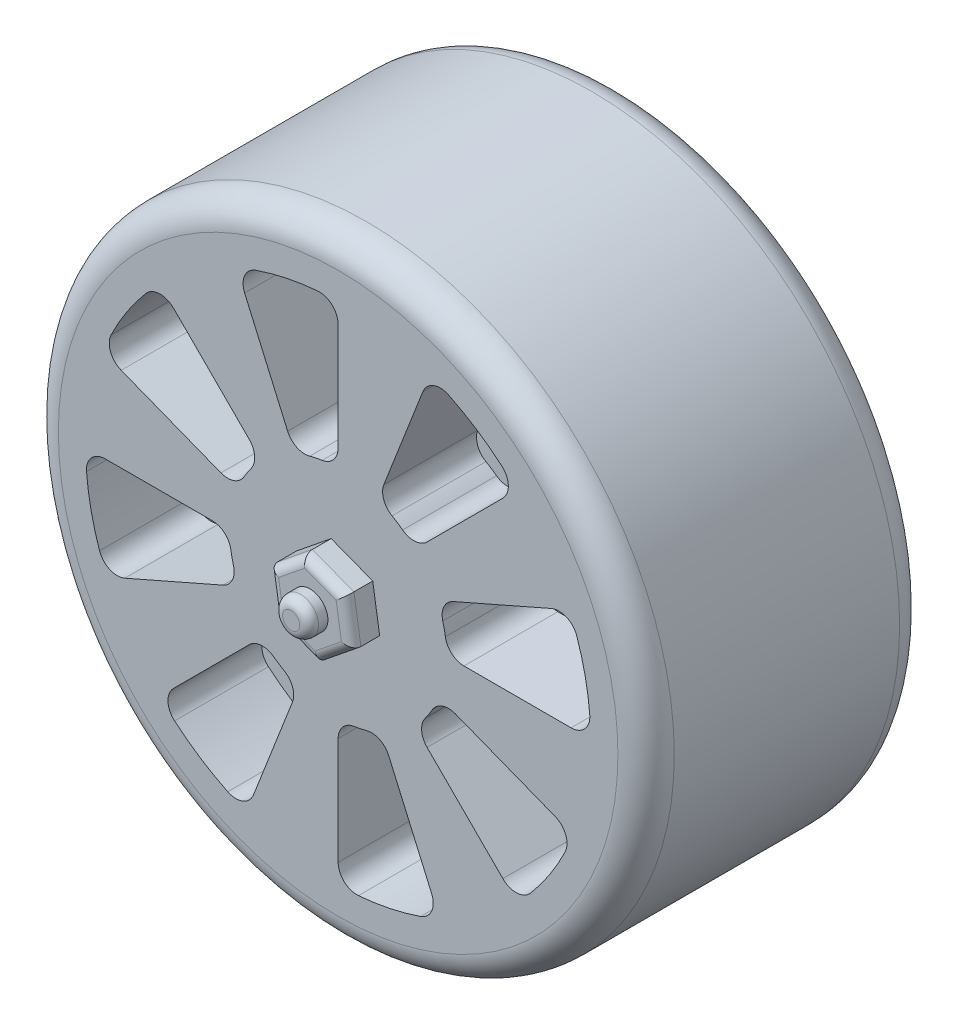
ISO-10303-21;
HEADER;
FILE_DESCRIPTION(('STEP AP214'),'2;1');
FILE_NAME('part.step','',(''),(''),'','','');
FILE_SCHEMA(('AUTOMOTIVE_DESIGN { 1 0 10303 214 1 1 1 1 }'));
ENDSEC;
DATA;
#1=APPLICATION_CONTEXT('core data for automotive mechanical design processes');
#2=APPLICATION_PROTOCOL_DEFINITION('international standard','automotive_design',2000,#1);
#3=PRODUCT_CONTEXT('',#1,'mechanical');
#4=PRODUCT('Part','Part','',(#3));
#5=PRODUCT_RELATED_PRODUCT_CATEGORY('part','',(#4));
#6=PRODUCT_DEFINITION_FORMATION('','',#4);
#7=PRODUCT_DEFINITION_CONTEXT('part definition',#1,'design');
#8=PRODUCT_DEFINITION('design','',#6,#7);
#9=PRODUCT_DEFINITION_SHAPE('','',#8);
#10=(LENGTH_UNIT() NAMED_UNIT(*) SI_UNIT(.MILLI.,.METRE.));
#11=(NAMED_UNIT(*) PLANE_ANGLE_UNIT() SI_UNIT($,.RADIAN.));
#12=(NAMED_UNIT(*) SI_UNIT($,.STERADIAN.) SOLID_ANGLE_UNIT());
#13=UNCERTAINTY_MEASURE_WITH_UNIT(LENGTH_MEASURE(1.E-05),#10,'distance_accuracy_value','');
#14=(GEOMETRIC_REPRESENTATION_CONTEXT(3) GLOBAL_UNCERTAINTY_ASSIGNED_CONTEXT((#13)) GLOBAL_UNIT_ASSIGNED_CONTEXT((#10,
#11,#12)) REPRESENTATION_CONTEXT('',''));
#15=CARTESIAN_POINT('',(0.,0.,0.));
#16=DIRECTION('',(0.,0.,1.));
#17=DIRECTION('',(1.,0.,0.));
#18=AXIS2_PLACEMENT_3D('',#15,#16,#17);
#19=CARTESIAN_POINT('',(-2220.03030574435,-1662.91999761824,394.065445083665));
#20=DIRECTION('',(0.,0.,1.));
#21=DIRECTION('',(1.,0.,0.));
#22=AXIS2_PLACEMENT_3D('',#19,#20,#21);
#23=PLANE('',#22);
#24=DIRECTION('',(-0.933598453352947,0.358320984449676,0.));
#25=VECTOR('',#24,1.);
#26=CARTESIAN_POINT('',(94.8521777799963,162.421685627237,394.065445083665));
#27=LINE('',#26,#25);
#28=CARTESIAN_POINT('',(172.5198018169,132.61236085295,394.065445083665));
#29=VERTEX_POINT('',#28);
#30=CARTESIAN_POINT('',(105.632444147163,158.284151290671,394.065445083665));
#31=VERTEX_POINT('',#30);
#32=EDGE_CURVE('E1064',#29,#31,#27,.T.);
#33=ORIENTED_EDGE('',*,*,#32,.T.);
#34=DIRECTION('',(-0.777114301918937,-0.629359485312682,0.));
#35=VECTOR('',#34,1.);
#36=CARTESIAN_POINT('',(40.9829996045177,105.926678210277,394.065445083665));
#37=LINE('',#36,#35);
#38=CARTESIAN_POINT('',(49.9563426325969,113.193895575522,394.065445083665));
#39=VERTEX_POINT('',#38);
#40=EDGE_CURVE('E1074',#31,#39,#37,.T.);
#41=ORIENTED_EDGE('',*,*,#40,.T.);
#42=DIRECTION('',(0.156484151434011,-0.987680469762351,0.));
#43=VECTOR('',#42,1.);
#44=CARTESIAN_POINT('',(62.9745221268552,31.027097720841,394.065445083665));
#45=LINE('',#44,#43);
#46=CARTESIAN_POINT('',(61.1675987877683,42.4318494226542,394.065445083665));
#47=VERTEX_POINT('',#46);
#48=EDGE_CURVE('E1072',#39,#47,#45,.T.);
#49=ORIENTED_EDGE('',*,*,#48,.T.);
#50=DIRECTION('',(0.933598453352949,-0.358320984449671,0.));
#51=VECTOR('',#50,1.);
#52=CARTESIAN_POINT('',(138.835222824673,12.6225246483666,394.065445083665));
#53=LINE('',#52,#51);
#54=CARTESIAN_POINT('',(128.054956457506,16.7600589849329,394.065445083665));
#55=VERTEX_POINT('',#54);
#56=EDGE_CURVE('E1070',#47,#55,#53,.T.);
#57=ORIENTED_EDGE('',*,*,#56,.T.);
#58=DIRECTION('',(0.777114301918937,0.629359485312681,0.));
#59=VECTOR('',#58,1.);
#60=CARTESIAN_POINT('',(192.704401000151,69.117532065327,394.065445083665));
#61=LINE('',#60,#59);
#62=CARTESIAN_POINT('',(183.731057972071,61.8503147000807,394.065445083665));
#63=VERTEX_POINT('',#62);
#64=EDGE_CURVE('E1068',#55,#63,#61,.T.);
#65=ORIENTED_EDGE('',*,*,#64,.T.);
#66=DIRECTION('',(-0.156484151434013,0.98768046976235,0.));
#67=VECTOR('',#66,1.);
#68=CARTESIAN_POINT('',(170.712878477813,144.017112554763,394.065445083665));
#69=LINE('',#68,#67);
#70=EDGE_CURVE('E1066',#63,#29,#69,.T.);
#71=ORIENTED_EDGE('',*,*,#70,.T.);
#72=EDGE_LOOP('',(#33,#41,#49,#57,#65,#71));
#73=FACE_BOUND('',#72,.T.);
#74=CARTESIAN_POINT('',(116.843700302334,87.5221051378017,394.065445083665));
#75=DIRECTION('',(0.,0.,1.));
#76=DIRECTION('',(1.,0.,0.));
#77=AXIS2_PLACEMENT_3D('',#74,#75,#76);
#78=CIRCLE('',#77,38.2383166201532);
#79=CARTESIAN_POINT('',(155.082016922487,87.5221051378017,394.065445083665));
#80=VERTEX_POINT('',#79);
#81=EDGE_CURVE('E509',#80,#80,#78,.T.);
#82=ORIENTED_EDGE('',*,*,#81,.F.);
#83=EDGE_LOOP('',(#82));
#84=FACE_BOUND('',#83,.T.);
#85=ADVANCED_FACE('F37',(#73,#84),#23,.T.);
#86=CARTESIAN_POINT('',(116.843700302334,87.5221051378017,334.065445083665));
#87=DIRECTION('',(0.,0.,1.));
#88=DIRECTION('',(1.,0.,0.));
#89=AXIS2_PLACEMENT_3D('',#86,#87,#88);
#90=PLANE('',#89);
#91=CARTESIAN_POINT('',(116.843700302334,87.5221051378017,334.065445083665));
#92=DIRECTION('',(0.,0.,1.));
#93=DIRECTION('',(1.,0.,0.));
#94=AXIS2_PLACEMENT_3D('',#91,#92,#93);
#95=CIRCLE('',#94,595.904346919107);
#96=CARTESIAN_POINT('',(712.748047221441,87.5221051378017,334.065445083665));
#97=VERTEX_POINT('',#96);
#98=EDGE_CURVE('E1055',#97,#97,#95,.T.);
#99=ORIENTED_EDGE('',*,*,#98,.T.);
#100=EDGE_LOOP('',(#99));
#101=FACE_BOUND('',#100,.T.);
#102=CARTESIAN_POINT('',(45.8939961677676,348.970478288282,334.065445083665));
#103=DIRECTION('',(0.,0.,1.));
#104=DIRECTION('',(-1.,0.,0.));
#105=AXIS2_PLACEMENT_3D('',#102,#103,#104);
#106=CIRCLE('',#105,40.0000000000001);
#107=CARTESIAN_POINT('',(9.26013905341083,332.909329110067,334.065445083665));
#108=VERTEX_POINT('',#107);
#109=CARTESIAN_POINT('',(56.3699786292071,310.366672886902,334.065445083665));
#110=VERTEX_POINT('',#109);
#111=EDGE_CURVE('E968',#108,#110,#106,.T.);
#112=ORIENTED_EDGE('',*,*,#111,.F.);
#113=DIRECTION('',(0.401528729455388,-0.915846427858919,0.));
#114=VECTOR('',#113,1.);
#115=CARTESIAN_POINT('',(9.26013905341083,332.909329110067,334.065445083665));
#116=LINE('',#115,#114);
#117=CARTESIAN_POINT('',(-82.3393196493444,541.838431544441,334.065445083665));
#118=VERTEX_POINT('',#117);
#119=EDGE_CURVE('E987',#118,#108,#116,.T.);
#120=ORIENTED_EDGE('',*,*,#119,.F.);
#121=CARTESIAN_POINT('',(-45.7054625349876,557.899580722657,334.065445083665));
#122=DIRECTION('',(0.,0.,1.));
#123=DIRECTION('',(-1.,0.,0.));
#124=AXIS2_PLACEMENT_3D('',#121,#122,#123);
#125=CIRCLE('',#124,40.);
#126=CARTESIAN_POINT('',(-58.7702308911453,595.705821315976,334.065445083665));
#127=VERTEX_POINT('',#126);
#128=EDGE_CURVE('E1025',#127,#118,#125,.T.);
#129=ORIENTED_EDGE('',*,*,#128,.F.);
#130=CARTESIAN_POINT('',(116.843700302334,87.5221051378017,334.065445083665));
#131=DIRECTION('',(0.,0.,1.));
#132=DIRECTION('',(1.,0.,0.));
#133=AXIS2_PLACEMENT_3D('',#130,#131,#132);
#134=CIRCLE('',#133,537.671779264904);
#135=CARTESIAN_POINT('',(73.6287299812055,623.454384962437,334.065445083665));
#136=VERTEX_POINT('',#135);
#137=EDGE_CURVE('E1022',#136,#127,#134,.T.);
#138=ORIENTED_EDGE('',*,*,#137,.F.);
#139=CARTESIAN_POINT('',(76.8437003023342,583.583794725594,334.065445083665));
#140=DIRECTION('',(0.,0.,1.));
#141=DIRECTION('',(-1.,0.,0.));
#142=AXIS2_PLACEMENT_3D('',#139,#140,#141);
#143=CIRCLE('',#142,40.);
#144=CARTESIAN_POINT('',(116.843700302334,583.583794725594,334.065445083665));
#145=VERTEX_POINT('',#144);
#146=EDGE_CURVE('E1019',#145,#136,#143,.T.);
#147=ORIENTED_EDGE('',*,*,#146,.F.);
#148=DIRECTION('',(0.,1.,0.));
#149=VECTOR('',#148,1.);
#150=CARTESIAN_POINT('',(116.843700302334,355.457008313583,334.065445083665));
#151=LINE('',#150,#149);
#152=CARTESIAN_POINT('',(116.843700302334,355.457008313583,334.065445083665));
#153=VERTEX_POINT('',#152);
#154=EDGE_CURVE('E1016',#153,#145,#151,.T.);
#155=ORIENTED_EDGE('',*,*,#154,.F.);
#156=CARTESIAN_POINT('',(76.8437003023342,355.457008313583,334.065445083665));
#157=DIRECTION('',(0.,0.,1.));
#158=DIRECTION('',(1.,0.,0.));
#159=AXIS2_PLACEMENT_3D('',#156,#157,#158);
#160=CIRCLE('',#159,40.);
#161=CARTESIAN_POINT('',(82.7498461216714,315.89544310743,334.065445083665));
#162=VERTEX_POINT('',#161);
#163=EDGE_CURVE('E1013',#162,#153,#160,.T.);
#164=ORIENTED_EDGE('',*,*,#163,.F.);
#165=CARTESIAN_POINT('',(116.843700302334,87.5221051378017,334.065445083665));
#166=DIRECTION('',(0.,0.,-1.));
#167=DIRECTION('',(1.,0.,0.));
#168=AXIS2_PLACEMENT_3D('',#165,#166,#167);
#169=CIRCLE('',#168,230.904249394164);
#170=EDGE_CURVE('E1010',#110,#162,#169,.T.);
#171=ORIENTED_EDGE('',*,*,#170,.F.);
#172=EDGE_LOOP('',(#112,#120,#129,#138,#147,#155,#164,#171));
#173=FACE_BOUND('',#172,.T.);
#174=CARTESIAN_POINT('',(251.546600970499,322.563039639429,334.065445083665));
#175=DIRECTION('',(0.,0.,1.));
#176=DIRECTION('',(-0.707106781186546,0.707106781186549,0.));
#177=AXIS2_PLACEMENT_3D('',#174,#175,#176);
#178=CIRCLE('',#177,40.0000000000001);
#179=CARTESIAN_POINT('',(214.285604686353,337.110140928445,334.065445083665));
#180=VERTEX_POINT('',#179);
#181=CARTESIAN_POINT('',(231.657226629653,287.858388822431,334.065445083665));
#182=VERTEX_POINT('',#181);
#183=EDGE_CURVE('E904',#180,#182,#178,.T.);
#184=ORIENTED_EDGE('',*,*,#183,.F.);
#185=DIRECTION('',(-0.363677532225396,-0.93152490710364,0.));
#186=VECTOR('',#185,1.);
#187=CARTESIAN_POINT('',(214.285604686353,337.110140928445,334.065445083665));
#188=LINE('',#187,#186);
#189=CARTESIAN_POINT('',(297.250191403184,549.615924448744,334.065445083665));
#190=VERTEX_POINT('',#189);
#191=EDGE_CURVE('E923',#190,#180,#188,.T.);
#192=ORIENTED_EDGE('',*,*,#191,.F.);
#193=CARTESIAN_POINT('',(334.511187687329,535.068823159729,334.065445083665));
#194=DIRECTION('',(0.,0.,1.));
#195=DIRECTION('',(-0.707106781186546,0.707106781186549,0.));
#196=AXIS2_PLACEMENT_3D('',#193,#194,#195);
#197=CIRCLE('',#196,40.);
#198=CARTESIAN_POINT('',(352.006050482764,571.040058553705,334.065445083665));
#199=VERTEX_POINT('',#198);
#200=EDGE_CURVE('E961',#199,#190,#197,.T.);
#201=ORIENTED_EDGE('',*,*,#200,.F.);
#202=CARTESIAN_POINT('',(116.843700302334,87.5221051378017,334.065445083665));
#203=DIRECTION('',(0.,0.,1.));
#204=DIRECTION('',(0.707106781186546,-0.707106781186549,0.));
#205=AXIS2_PLACEMENT_3D('',#202,#203,#204);
#206=CIRCLE('',#205,537.671779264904);
#207=CARTESIAN_POINT('',(465.247451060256,497.041053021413,334.065445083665));
#208=VERTEX_POINT('',#207);
#209=EDGE_CURVE('E958',#208,#199,#206,.T.);
#210=ORIENTED_EDGE('',*,*,#209,.F.);
#211=CARTESIAN_POINT('',(439.328013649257,466.574960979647,334.065445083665));
#212=DIRECTION('',(0.,0.,1.));
#213=DIRECTION('',(-0.707106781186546,0.707106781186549,0.));
#214=AXIS2_PLACEMENT_3D('',#211,#212,#213);
#215=CIRCLE('',#214,40.);
#216=CARTESIAN_POINT('',(467.612284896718,438.290689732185,334.065445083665));
#217=VERTEX_POINT('',#216);
#218=EDGE_CURVE('E955',#217,#208,#215,.T.);
#219=ORIENTED_EDGE('',*,*,#218,.F.);
#220=DIRECTION('',(0.707106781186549,0.707106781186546,0.));
#221=VECTOR('',#220,1.);
#222=CARTESIAN_POINT('',(306.302287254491,276.980692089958,334.065445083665));
#223=LINE('',#222,#221);
#224=CARTESIAN_POINT('',(306.302287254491,276.980692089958,334.065445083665));
#225=VERTEX_POINT('',#224);
#226=EDGE_CURVE('E952',#225,#217,#223,.T.);
#227=ORIENTED_EDGE('',*,*,#226,.F.);
#228=CARTESIAN_POINT('',(278.018016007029,305.26496333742,334.065445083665));
#229=DIRECTION('',(0.,0.,1.));
#230=DIRECTION('',(0.707106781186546,-0.707106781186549,0.));
#231=AXIS2_PLACEMENT_3D('',#228,#229,#230);
#232=CIRCLE('',#231,40.);
#233=CARTESIAN_POINT('',(254.220040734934,273.114436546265,334.065445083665));
#234=VERTEX_POINT('',#233);
#235=EDGE_CURVE('E949',#234,#225,#232,.T.);
#236=ORIENTED_EDGE('',*,*,#235,.F.);
#237=CARTESIAN_POINT('',(116.843700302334,87.5221051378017,334.065445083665));
#238=DIRECTION('',(0.,0.,-1.));
#239=DIRECTION('',(0.707106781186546,-0.707106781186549,0.));
#240=AXIS2_PLACEMENT_3D('',#237,#238,#239);
#241=CIRCLE('',#240,230.904249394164);
#242=EDGE_CURVE('E946',#182,#234,#241,.T.);
#243=ORIENTED_EDGE('',*,*,#242,.F.);
#244=EDGE_LOOP('',(#184,#192,#201,#210,#219,#227,#236,#243));
#245=FACE_BOUND('',#244,.T.);
#246=CARTESIAN_POINT('',(378.292073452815,158.471809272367,334.065445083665));
#247=DIRECTION('',(0.,0.,1.));
#248=DIRECTION('',(0.,1.,0.));
#249=AXIS2_PLACEMENT_3D('',#246,#247,#248);
#250=CIRCLE('',#249,40.0000000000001);
#251=CARTESIAN_POINT('',(362.2309242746,195.105666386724,334.065445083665));
#252=VERTEX_POINT('',#251);
#253=CARTESIAN_POINT('',(339.688268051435,147.995826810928,334.065445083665));
#254=VERTEX_POINT('',#253);
#255=EDGE_CURVE('E840',#252,#254,#250,.T.);
#256=ORIENTED_EDGE('',*,*,#255,.F.);
#257=DIRECTION('',(-0.91584642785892,-0.401528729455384,0.));
#258=VECTOR('',#257,1.);
#259=CARTESIAN_POINT('',(362.2309242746,195.105666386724,334.065445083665));
#260=LINE('',#259,#258);
#261=CARTESIAN_POINT('',(571.160026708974,286.705125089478,334.065445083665));
#262=VERTEX_POINT('',#261);
#263=EDGE_CURVE('E859',#262,#252,#260,.T.);
#264=ORIENTED_EDGE('',*,*,#263,.F.);
#265=CARTESIAN_POINT('',(587.22117588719,250.071267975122,334.065445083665));
#266=DIRECTION('',(0.,0.,1.));
#267=DIRECTION('',(0.,1.,0.));
#268=AXIS2_PLACEMENT_3D('',#265,#266,#267);
#269=CIRCLE('',#268,40.);
#270=CARTESIAN_POINT('',(625.027416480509,263.136036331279,334.065445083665));
#271=VERTEX_POINT('',#270);
#272=EDGE_CURVE('E897',#271,#262,#269,.T.);
#273=ORIENTED_EDGE('',*,*,#272,.F.);
#274=CARTESIAN_POINT('',(116.843700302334,87.5221051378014,334.065445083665));
#275=DIRECTION('',(0.,0.,1.));
#276=DIRECTION('',(0.,-1.,0.));
#277=AXIS2_PLACEMENT_3D('',#274,#275,#276);
#278=CIRCLE('',#277,537.671779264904);
#279=CARTESIAN_POINT('',(652.775980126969,130.737075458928,334.065445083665));
#280=VERTEX_POINT('',#279);
#281=EDGE_CURVE('E894',#280,#271,#278,.T.);
#282=ORIENTED_EDGE('',*,*,#281,.F.);
#283=CARTESIAN_POINT('',(612.905389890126,127.5221051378,334.065445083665));
#284=DIRECTION('',(0.,0.,1.));
#285=DIRECTION('',(0.,1.,0.));
#286=AXIS2_PLACEMENT_3D('',#283,#284,#285);
#287=CIRCLE('',#286,40.);
#288=CARTESIAN_POINT('',(612.905389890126,87.5221051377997,334.065445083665));
#289=VERTEX_POINT('',#288);
#290=EDGE_CURVE('E891',#289,#280,#287,.T.);
#291=ORIENTED_EDGE('',*,*,#290,.F.);
#292=DIRECTION('',(1.,0.,0.));
#293=VECTOR('',#292,1.);
#294=CARTESIAN_POINT('',(384.778603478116,87.5221051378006,334.065445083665));
#295=LINE('',#294,#293);
#296=CARTESIAN_POINT('',(384.778603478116,87.5221051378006,334.065445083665));
#297=VERTEX_POINT('',#296);
#298=EDGE_CURVE('E888',#297,#289,#295,.T.);
#299=ORIENTED_EDGE('',*,*,#298,.F.);
#300=CARTESIAN_POINT('',(384.778603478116,127.522105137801,334.065445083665));
#301=DIRECTION('',(0.,0.,1.));
#302=DIRECTION('',(0.,-1.,0.));
#303=AXIS2_PLACEMENT_3D('',#300,#301,#302);
#304=CIRCLE('',#303,40.);
#305=CARTESIAN_POINT('',(345.217038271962,121.615959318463,334.065445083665));
#306=VERTEX_POINT('',#305);
#307=EDGE_CURVE('E885',#306,#297,#304,.T.);
#308=ORIENTED_EDGE('',*,*,#307,.F.);
#309=CARTESIAN_POINT('',(116.843700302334,87.5221051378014,334.065445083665));
#310=DIRECTION('',(0.,0.,-1.));
#311=DIRECTION('',(0.,-1.,0.));
#312=AXIS2_PLACEMENT_3D('',#309,#310,#311);
#313=CIRCLE('',#312,230.904249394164);
#314=EDGE_CURVE('E882',#254,#306,#313,.T.);
#315=ORIENTED_EDGE('',*,*,#314,.F.);
#316=EDGE_LOOP('',(#256,#264,#273,#282,#291,#299,#308,#315));
#317=FACE_BOUND('',#316,.T.);
#318=CARTESIAN_POINT('',(351.884634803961,-47.1807955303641,334.065445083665));
#319=DIRECTION('',(0.,0.,1.));
#320=DIRECTION('',(0.707106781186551,0.707106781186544,0.));
#321=AXIS2_PLACEMENT_3D('',#318,#319,#320);
#322=CIRCLE('',#321,40.0000000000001);
#323=CARTESIAN_POINT('',(366.431736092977,-9.91979924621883,334.065445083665));
#324=VERTEX_POINT('',#323);
#325=CARTESIAN_POINT('',(317.179983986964,-27.2914211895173,334.065445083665));
#326=VERTEX_POINT('',#325);
#327=EDGE_CURVE('E776',#324,#326,#322,.T.);
#328=ORIENTED_EDGE('',*,*,#327,.F.);
#329=DIRECTION('',(-0.931524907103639,0.3636775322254,0.));
#330=VECTOR('',#329,1.);
#331=CARTESIAN_POINT('',(366.431736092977,-9.91979924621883,334.065445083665));
#332=LINE('',#331,#330);
#333=CARTESIAN_POINT('',(578.937519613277,-92.8843859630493,334.065445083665));
#334=VERTEX_POINT('',#333);
#335=EDGE_CURVE('E795',#334,#324,#332,.T.);
#336=ORIENTED_EDGE('',*,*,#335,.F.);
#337=CARTESIAN_POINT('',(564.390418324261,-130.145382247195,334.065445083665));
#338=DIRECTION('',(0.,0.,1.));
#339=DIRECTION('',(0.707106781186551,0.707106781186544,0.));
#340=AXIS2_PLACEMENT_3D('',#337,#338,#339);
#341=CIRCLE('',#340,40.);
#342=CARTESIAN_POINT('',(600.361653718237,-147.64024504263,334.065445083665));
#343=VERTEX_POINT('',#342);
#344=EDGE_CURVE('E833',#343,#334,#341,.T.);
#345=ORIENTED_EDGE('',*,*,#344,.F.);
#346=CARTESIAN_POINT('',(116.843700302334,87.5221051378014,334.065445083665));
#347=DIRECTION('',(0.,0.,1.));
#348=DIRECTION('',(-0.707106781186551,-0.707106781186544,0.));
#349=AXIS2_PLACEMENT_3D('',#346,#347,#348);
#350=CIRCLE('',#349,537.671779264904);
#351=CARTESIAN_POINT('',(526.362648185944,-260.881645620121,334.065445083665));
#352=VERTEX_POINT('',#351);
#353=EDGE_CURVE('E830',#352,#343,#350,.T.);
#354=ORIENTED_EDGE('',*,*,#353,.F.);
#355=CARTESIAN_POINT('',(495.896556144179,-234.962208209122,334.065445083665));
#356=DIRECTION('',(0.,0.,1.));
#357=DIRECTION('',(0.707106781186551,0.707106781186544,0.));
#358=AXIS2_PLACEMENT_3D('',#355,#356,#357);
#359=CIRCLE('',#358,40.);
#360=CARTESIAN_POINT('',(467.612284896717,-263.246479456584,334.065445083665));
#361=VERTEX_POINT('',#360);
#362=EDGE_CURVE('E827',#361,#352,#359,.T.);
#363=ORIENTED_EDGE('',*,*,#362,.F.);
#364=DIRECTION('',(0.707106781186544,-0.707106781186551,0.));
#365=VECTOR('',#364,1.);
#366=CARTESIAN_POINT('',(306.30228725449,-101.936481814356,334.065445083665));
#367=LINE('',#366,#365);
#368=CARTESIAN_POINT('',(306.30228725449,-101.936481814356,334.065445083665));
#369=VERTEX_POINT('',#368);
#370=EDGE_CURVE('E824',#369,#361,#367,.T.);
#371=ORIENTED_EDGE('',*,*,#370,.F.);
#372=CARTESIAN_POINT('',(334.586558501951,-73.6522105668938,334.065445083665));
#373=DIRECTION('',(0.,0.,1.));
#374=DIRECTION('',(-0.707106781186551,-0.707106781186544,0.));
#375=AXIS2_PLACEMENT_3D('',#372,#373,#374);
#376=CIRCLE('',#375,40.);
#377=CARTESIAN_POINT('',(302.436031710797,-49.8542352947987,334.065445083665));
#378=VERTEX_POINT('',#377);
#379=EDGE_CURVE('E821',#378,#369,#376,.T.);
#380=ORIENTED_EDGE('',*,*,#379,.F.);
#381=CARTESIAN_POINT('',(116.843700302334,87.5221051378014,334.065445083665));
#382=DIRECTION('',(0.,0.,-1.));
#383=DIRECTION('',(-0.707106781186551,-0.707106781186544,0.));
#384=AXIS2_PLACEMENT_3D('',#381,#382,#383);
#385=CIRCLE('',#384,230.904249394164);
#386=EDGE_CURVE('E818',#326,#378,#385,.T.);
#387=ORIENTED_EDGE('',*,*,#386,.F.);
#388=EDGE_LOOP('',(#328,#336,#345,#354,#363,#371,#380,#387));
#389=FACE_BOUND('',#388,.T.);
#390=CARTESIAN_POINT('',(187.793404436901,-173.926268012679,334.065445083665));
#391=DIRECTION('',(0.,0.,1.));
#392=DIRECTION('',(1.,0.,0.));
#393=AXIS2_PLACEMENT_3D('',#390,#391,#392);
#394=CIRCLE('',#393,40.0000000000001);
#395=CARTESIAN_POINT('',(224.427261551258,-157.865118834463,334.065445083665));
#396=VERTEX_POINT('',#395);
#397=CARTESIAN_POINT('',(177.317421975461,-135.322462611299,334.065445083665));
#398=VERTEX_POINT('',#397);
#399=EDGE_CURVE('E712',#396,#398,#394,.T.);
#400=ORIENTED_EDGE('',*,*,#399,.F.);
#401=DIRECTION('',(-0.401528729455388,0.915846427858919,0.));
#402=VECTOR('',#401,1.);
#403=CARTESIAN_POINT('',(224.427261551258,-157.865118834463,334.065445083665));
#404=LINE('',#403,#402);
#405=CARTESIAN_POINT('',(316.026720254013,-366.794221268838,334.065445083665));
#406=VERTEX_POINT('',#405);
#407=EDGE_CURVE('E731',#406,#396,#404,.T.);
#408=ORIENTED_EDGE('',*,*,#407,.F.);
#409=CARTESIAN_POINT('',(279.392863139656,-382.855370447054,334.065445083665));
#410=DIRECTION('',(0.,0.,1.));
#411=DIRECTION('',(1.,0.,0.));
#412=AXIS2_PLACEMENT_3D('',#409,#410,#411);
#413=CIRCLE('',#412,40.);
#414=CARTESIAN_POINT('',(292.457631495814,-420.661611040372,334.065445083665));
#415=VERTEX_POINT('',#414);
#416=EDGE_CURVE('E769',#415,#406,#413,.T.);
#417=ORIENTED_EDGE('',*,*,#416,.F.);
#418=CARTESIAN_POINT('',(116.843700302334,87.5221051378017,334.065445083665));
#419=DIRECTION('',(0.,0.,1.));
#420=DIRECTION('',(-1.,0.,0.));
#421=AXIS2_PLACEMENT_3D('',#418,#419,#420);
#422=CIRCLE('',#421,537.671779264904);
#423=CARTESIAN_POINT('',(160.058670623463,-448.410174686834,334.065445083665));
#424=VERTEX_POINT('',#423);
#425=EDGE_CURVE('E766',#424,#415,#422,.T.);
#426=ORIENTED_EDGE('',*,*,#425,.F.);
#427=CARTESIAN_POINT('',(156.843700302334,-408.53958444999,334.065445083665));
#428=DIRECTION('',(0.,0.,1.));
#429=DIRECTION('',(1.,0.,0.));
#430=AXIS2_PLACEMENT_3D('',#427,#428,#429);
#431=CIRCLE('',#430,40.);
#432=CARTESIAN_POINT('',(116.843700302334,-408.53958444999,334.065445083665));
#433=VERTEX_POINT('',#432);
#434=EDGE_CURVE('E763',#433,#424,#431,.T.);
#435=ORIENTED_EDGE('',*,*,#434,.F.);
#436=DIRECTION('',(0.,-1.,0.));
#437=VECTOR('',#436,1.);
#438=CARTESIAN_POINT('',(116.843700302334,-180.41279803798,334.065445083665));
#439=LINE('',#438,#437);
#440=CARTESIAN_POINT('',(116.843700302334,-180.41279803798,334.065445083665));
#441=VERTEX_POINT('',#440);
#442=EDGE_CURVE('E760',#441,#433,#439,.T.);
#443=ORIENTED_EDGE('',*,*,#442,.F.);
#444=CARTESIAN_POINT('',(156.843700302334,-180.41279803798,334.065445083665));
#445=DIRECTION('',(0.,0.,1.));
#446=DIRECTION('',(-1.,0.,0.));
#447=AXIS2_PLACEMENT_3D('',#444,#445,#446);
#448=CIRCLE('',#447,40.);
#449=CARTESIAN_POINT('',(150.937554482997,-140.851232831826,334.065445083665));
#450=VERTEX_POINT('',#449);
#451=EDGE_CURVE('E757',#450,#441,#448,.T.);
#452=ORIENTED_EDGE('',*,*,#451,.F.);
#453=CARTESIAN_POINT('',(116.843700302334,87.5221051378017,334.065445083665));
#454=DIRECTION('',(0.,0.,-1.));
#455=DIRECTION('',(-1.,0.,0.));
#456=AXIS2_PLACEMENT_3D('',#453,#454,#455);
#457=CIRCLE('',#456,230.904249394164);
#458=EDGE_CURVE('E754',#398,#450,#457,.T.);
#459=ORIENTED_EDGE('',*,*,#458,.F.);
#460=EDGE_LOOP('',(#400,#408,#417,#426,#435,#443,#452,#459));
#461=FACE_BOUND('',#460,.T.);
#462=CARTESIAN_POINT('',(-17.8592003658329,-147.518829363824,334.065445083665));
#463=DIRECTION('',(0.,0.,1.));
#464=DIRECTION('',(0.707106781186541,-0.707106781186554,0.));
#465=AXIS2_PLACEMENT_3D('',#462,#463,#464);
#466=CIRCLE('',#465,40.0000000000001);
#467=CARTESIAN_POINT('',(19.4017959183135,-162.06593065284,334.065445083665));
#468=VERTEX_POINT('',#467);
#469=CARTESIAN_POINT('',(2.03017397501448,-112.814178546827,334.065445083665));
#470=VERTEX_POINT('',#469);
#471=EDGE_CURVE('E648',#468,#470,#466,.T.);
#472=ORIENTED_EDGE('',*,*,#471,.F.);
#473=DIRECTION('',(0.363677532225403,0.931524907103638,0.));
#474=VECTOR('',#473,1.);
#475=CARTESIAN_POINT('',(19.4017959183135,-162.06593065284,334.065445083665));
#476=LINE('',#475,#474);
#477=CARTESIAN_POINT('',(-63.5627907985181,-374.57171417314,334.065445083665));
#478=VERTEX_POINT('',#477);
#479=EDGE_CURVE('E667',#478,#468,#476,.T.);
#480=ORIENTED_EDGE('',*,*,#479,.F.);
#481=CARTESIAN_POINT('',(-100.823787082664,-360.024612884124,334.065445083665));
#482=DIRECTION('',(0.,0.,1.));
#483=DIRECTION('',(0.707106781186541,-0.707106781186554,0.));
#484=AXIS2_PLACEMENT_3D('',#481,#482,#483);
#485=CIRCLE('',#484,40.);
#486=CARTESIAN_POINT('',(-118.3186498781,-395.9958482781,334.065445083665));
#487=VERTEX_POINT('',#486);
#488=EDGE_CURVE('E705',#487,#478,#485,.T.);
#489=ORIENTED_EDGE('',*,*,#488,.F.);
#490=CARTESIAN_POINT('',(116.843700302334,87.522105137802,334.065445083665));
#491=DIRECTION('',(0.,0.,1.));
#492=DIRECTION('',(-0.707106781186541,0.707106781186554,0.));
#493=AXIS2_PLACEMENT_3D('',#490,#491,#492);
#494=CIRCLE('',#493,537.671779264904);
#495=CARTESIAN_POINT('',(-231.560050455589,-321.996842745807,334.065445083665));
#496=VERTEX_POINT('',#495);
#497=EDGE_CURVE('E702',#496,#487,#494,.T.);
#498=ORIENTED_EDGE('',*,*,#497,.F.);
#499=CARTESIAN_POINT('',(-205.640613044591,-291.530750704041,334.065445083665));
#500=DIRECTION('',(0.,0.,1.));
#501=DIRECTION('',(0.707106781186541,-0.707106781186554,0.));
#502=AXIS2_PLACEMENT_3D('',#499,#500,#501);
#503=CIRCLE('',#502,40.);
#504=CARTESIAN_POINT('',(-233.924884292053,-263.246479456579,334.065445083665));
#505=VERTEX_POINT('',#504);
#506=EDGE_CURVE('E699',#505,#496,#503,.T.);
#507=ORIENTED_EDGE('',*,*,#506,.F.);
#508=DIRECTION('',(-0.707106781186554,-0.707106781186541,0.));
#509=VECTOR('',#508,1.);
#510=CARTESIAN_POINT('',(-72.6148866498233,-101.936481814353,334.065445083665));
#511=LINE('',#510,#509);
#512=CARTESIAN_POINT('',(-72.6148866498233,-101.936481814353,334.065445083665));
#513=VERTEX_POINT('',#512);
#514=EDGE_CURVE('E696',#513,#505,#511,.T.);
#515=ORIENTED_EDGE('',*,*,#514,.F.);
#516=CARTESIAN_POINT('',(-44.330615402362,-130.220753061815,334.065445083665));
#517=DIRECTION('',(0.,0.,1.));
#518=DIRECTION('',(-0.707106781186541,0.707106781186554,0.));
#519=AXIS2_PLACEMENT_3D('',#516,#517,#518);
#520=CIRCLE('',#519,40.);
#521=CARTESIAN_POINT('',(-20.5326401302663,-98.0702262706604,334.065445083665));
#522=VERTEX_POINT('',#521);
#523=EDGE_CURVE('E693',#522,#513,#520,.T.);
#524=ORIENTED_EDGE('',*,*,#523,.F.);
#525=CARTESIAN_POINT('',(116.843700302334,87.522105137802,334.065445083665));
#526=DIRECTION('',(0.,0.,-1.));
#527=DIRECTION('',(-0.707106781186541,0.707106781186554,0.));
#528=AXIS2_PLACEMENT_3D('',#525,#526,#527);
#529=CIRCLE('',#528,230.904249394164);
#530=EDGE_CURVE('E690',#470,#522,#529,.T.);
#531=ORIENTED_EDGE('',*,*,#530,.F.);
#532=EDGE_LOOP('',(#472,#480,#489,#498,#507,#515,#524,#531));
#533=FACE_BOUND('',#532,.T.);
#534=CARTESIAN_POINT('',(-144.604672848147,16.5724010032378,334.065445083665));
#535=DIRECTION('',(0.,0.,1.));
#536=DIRECTION('',(0.,-1.,0.));
#537=AXIS2_PLACEMENT_3D('',#534,#535,#536);
#538=CIRCLE('',#537,40.0000000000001);
#539=CARTESIAN_POINT('',(-128.543523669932,-20.0614561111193,334.065445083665));
#540=VERTEX_POINT('',#539);
#541=CARTESIAN_POINT('',(-106.000867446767,27.0483834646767,334.065445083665));
#542=VERTEX_POINT('',#541);
#543=EDGE_CURVE('E584',#540,#542,#538,.T.);
#544=ORIENTED_EDGE('',*,*,#543,.F.);
#545=DIRECTION('',(0.915846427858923,0.401528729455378,0.));
#546=VECTOR('',#545,1.);
#547=CARTESIAN_POINT('',(-128.543523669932,-20.0614561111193,334.065445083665));
#548=LINE('',#547,#546);
#549=CARTESIAN_POINT('',(-337.472626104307,-111.660914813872,334.065445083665));
#550=VERTEX_POINT('',#549);
#551=EDGE_CURVE('E603',#550,#540,#548,.T.);
#552=ORIENTED_EDGE('',*,*,#551,.F.);
#553=CARTESIAN_POINT('',(-353.533775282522,-75.0270576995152,334.065445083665));
#554=DIRECTION('',(0.,0.,1.));
#555=DIRECTION('',(0.,-1.,0.));
#556=AXIS2_PLACEMENT_3D('',#553,#554,#555);
#557=CIRCLE('',#556,40.);
#558=CARTESIAN_POINT('',(-391.340015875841,-88.0918260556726,334.065445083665));
#559=VERTEX_POINT('',#558);
#560=EDGE_CURVE('E641',#559,#550,#557,.T.);
#561=ORIENTED_EDGE('',*,*,#560,.F.);
#562=CARTESIAN_POINT('',(116.843700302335,87.5221051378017,334.065445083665));
#563=DIRECTION('',(0.,0.,1.));
#564=DIRECTION('',(0.,1.,0.));
#565=AXIS2_PLACEMENT_3D('',#562,#563,#564);
#566=CIRCLE('',#565,537.671779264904);
#567=CARTESIAN_POINT('',(-419.088579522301,44.3071348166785,334.065445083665));
#568=VERTEX_POINT('',#567);
#569=EDGE_CURVE('E638',#568,#559,#566,.T.);
#570=ORIENTED_EDGE('',*,*,#569,.F.);
#571=CARTESIAN_POINT('',(-379.217989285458,47.5221051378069,334.065445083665));
#572=DIRECTION('',(0.,0.,1.));
#573=DIRECTION('',(0.,-1.,0.));
#574=AXIS2_PLACEMENT_3D('',#571,#572,#573);
#575=CIRCLE('',#574,40.);
#576=CARTESIAN_POINT('',(-379.217989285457,87.5221051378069,334.065445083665));
#577=VERTEX_POINT('',#576);
#578=EDGE_CURVE('E635',#577,#568,#575,.T.);
#579=ORIENTED_EDGE('',*,*,#578,.F.);
#580=DIRECTION('',(-1.,0.,0.));
#581=VECTOR('',#580,1.);
#582=CARTESIAN_POINT('',(-151.091202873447,87.5221051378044,334.065445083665));
#583=LINE('',#582,#581);
#584=CARTESIAN_POINT('',(-151.091202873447,87.5221051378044,334.065445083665));
#585=VERTEX_POINT('',#584);
#586=EDGE_CURVE('E632',#585,#577,#583,.T.);
#587=ORIENTED_EDGE('',*,*,#586,.F.);
#588=CARTESIAN_POINT('',(-151.091202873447,47.5221051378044,334.065445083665));
#589=DIRECTION('',(0.,0.,1.));
#590=DIRECTION('',(0.,1.,0.));
#591=AXIS2_PLACEMENT_3D('',#588,#589,#590);
#592=CIRCLE('',#591,40.);
#593=CARTESIAN_POINT('',(-111.529637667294,53.4282509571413,334.065445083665));
#594=VERTEX_POINT('',#593);
#595=EDGE_CURVE('E629',#594,#585,#592,.T.);
#596=ORIENTED_EDGE('',*,*,#595,.F.);
#597=CARTESIAN_POINT('',(116.843700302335,87.5221051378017,334.065445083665));
#598=DIRECTION('',(0.,0.,-1.));
#599=DIRECTION('',(0.,1.,0.));
#600=AXIS2_PLACEMENT_3D('',#597,#598,#599);
#601=CIRCLE('',#600,230.904249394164);
#602=EDGE_CURVE('E626',#542,#594,#601,.T.);
#603=ORIENTED_EDGE('',*,*,#602,.F.);
#604=EDGE_LOOP('',(#544,#552,#561,#570,#579,#587,#596,#603));
#605=FACE_BOUND('',#604,.T.);
#606=CARTESIAN_POINT('',(-118.197234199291,222.225005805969,334.065445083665));
#607=DIRECTION('',(0.,0.,1.));
#608=DIRECTION('',(-0.707106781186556,-0.707106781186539,0.));
#609=AXIS2_PLACEMENT_3D('',#606,#607,#608);
#610=CIRCLE('',#609,40.0000000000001);
#611=CARTESIAN_POINT('',(-132.744335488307,184.964009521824,334.065445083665));
#612=VERTEX_POINT('',#611);
#613=CARTESIAN_POINT('',(-83.4925833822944,202.335631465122,334.065445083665));
#614=VERTEX_POINT('',#613);
#615=EDGE_CURVE('E498',#612,#614,#610,.T.);
#616=ORIENTED_EDGE('',*,*,#615,.F.);
#617=DIRECTION('',(0.931524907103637,-0.363677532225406,0.));
#618=VECTOR('',#617,1.);
#619=CARTESIAN_POINT('',(-132.744335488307,184.964009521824,334.065445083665));
#620=LINE('',#619,#618);
#621=CARTESIAN_POINT('',(-345.250119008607,267.928596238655,334.065445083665));
#622=VERTEX_POINT('',#621);
#623=EDGE_CURVE('E539',#622,#612,#620,.T.);
#624=ORIENTED_EDGE('',*,*,#623,.F.);
#625=CARTESIAN_POINT('',(-330.70301771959,305.189592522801,334.065445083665));
#626=DIRECTION('',(0.,0.,1.));
#627=DIRECTION('',(-0.707106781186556,-0.707106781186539,0.));
#628=AXIS2_PLACEMENT_3D('',#625,#626,#627);
#629=CIRCLE('',#628,40.);
#630=CARTESIAN_POINT('',(-366.674253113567,322.684455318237,334.065445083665));
#631=VERTEX_POINT('',#630);
#632=EDGE_CURVE('E577',#631,#622,#629,.T.);
#633=ORIENTED_EDGE('',*,*,#632,.F.);
#634=CARTESIAN_POINT('',(116.843700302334,87.5221051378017,334.065445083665));
#635=DIRECTION('',(0.,0.,1.));
#636=DIRECTION('',(0.707106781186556,0.707106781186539,0.));
#637=AXIS2_PLACEMENT_3D('',#634,#635,#636);
#638=CIRCLE('',#637,537.671779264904);
#639=CARTESIAN_POINT('',(-292.675247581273,435.925855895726,334.065445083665));
#640=VERTEX_POINT('',#639);
#641=EDGE_CURVE('E574',#640,#631,#638,.T.);
#642=ORIENTED_EDGE('',*,*,#641,.F.);
#643=CARTESIAN_POINT('',(-262.209155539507,410.006418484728,334.065445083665));
#644=DIRECTION('',(0.,0.,1.));
#645=DIRECTION('',(-0.707106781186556,-0.707106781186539,0.));
#646=AXIS2_PLACEMENT_3D('',#643,#644,#645);
#647=CIRCLE('',#646,40.);
#648=CARTESIAN_POINT('',(-233.924884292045,438.29068973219,334.065445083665));
#649=VERTEX_POINT('',#648);
#650=EDGE_CURVE('E571',#649,#640,#647,.T.);
#651=ORIENTED_EDGE('',*,*,#650,.F.);
#652=DIRECTION('',(-0.707106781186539,0.707106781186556,0.));
#653=VECTOR('',#652,1.);
#654=CARTESIAN_POINT('',(-72.6148866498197,276.98069208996,334.065445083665));
#655=LINE('',#654,#653);
#656=CARTESIAN_POINT('',(-72.6148866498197,276.98069208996,334.065445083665));
#657=VERTEX_POINT('',#656);
#658=EDGE_CURVE('E568',#657,#649,#655,.T.);
#659=ORIENTED_EDGE('',*,*,#658,.F.);
#660=CARTESIAN_POINT('',(-100.899157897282,248.696420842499,334.065445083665));
#661=DIRECTION('',(0.,0.,1.));
#662=DIRECTION('',(0.707106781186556,0.707106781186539,0.));
#663=AXIS2_PLACEMENT_3D('',#660,#661,#662);
#664=CIRCLE('',#663,40.);
#665=CARTESIAN_POINT('',(-68.7486311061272,224.898445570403,334.065445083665));
#666=VERTEX_POINT('',#665);
#667=EDGE_CURVE('E565',#666,#657,#664,.T.);
#668=ORIENTED_EDGE('',*,*,#667,.F.);
#669=CARTESIAN_POINT('',(116.843700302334,87.5221051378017,334.065445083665));
#670=DIRECTION('',(0.,0.,-1.));
#671=DIRECTION('',(0.707106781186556,0.707106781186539,0.));
#672=AXIS2_PLACEMENT_3D('',#669,#670,#671);
#673=CIRCLE('',#672,230.904249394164);
#674=EDGE_CURVE('E562',#614,#666,#673,.T.);
#675=ORIENTED_EDGE('',*,*,#674,.F.);
#676=EDGE_LOOP('',(#616,#624,#633,#642,#651,#659,#668,#675));
#677=FACE_BOUND('',#676,.T.);
#678=DIRECTION('',(-0.156484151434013,0.98768046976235,0.));
#679=VECTOR('',#678,1.);
#680=CARTESIAN_POINT('',(205.291590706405,53.5752460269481,334.065445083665));
#681=LINE('',#680,#679);
#682=CARTESIAN_POINT('',(205.291590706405,53.5752460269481,334.065445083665));
#683=VERTEX_POINT('',#682);
#684=CARTESIAN_POINT('',(190.466487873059,147.146795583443,334.065445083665));
#685=VERTEX_POINT('',#684);
#686=EDGE_CURVE('E494',#683,#685,#681,.T.);
#687=ORIENTED_EDGE('',*,*,#686,.F.);
#688=DIRECTION('',(0.777114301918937,0.629359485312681,0.));
#689=VECTOR('',#688,1.);
#690=CARTESIAN_POINT('',(131.668803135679,-6.04944441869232,334.065445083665));
#691=LINE('',#690,#689);
#692=CARTESIAN_POINT('',(131.668803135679,-6.04944441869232,334.065445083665));
#693=VERTEX_POINT('',#692);
#694=EDGE_CURVE('E502',#693,#683,#691,.T.);
#695=ORIENTED_EDGE('',*,*,#694,.F.);
#696=DIRECTION('',(0.933598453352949,-0.358320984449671,0.));
#697=VECTOR('',#696,1.);
#698=CARTESIAN_POINT('',(43.2209127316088,27.897414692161,334.065445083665));
#699=LINE('',#698,#697);
#700=CARTESIAN_POINT('',(43.2209127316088,27.897414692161,334.065445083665));
#701=VERTEX_POINT('',#700);
#702=EDGE_CURVE('E525',#701,#693,#699,.T.);
#703=ORIENTED_EDGE('',*,*,#702,.F.);
#704=DIRECTION('',(0.156484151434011,-0.987680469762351,0.));
#705=VECTOR('',#704,1.);
#706=CARTESIAN_POINT('',(28.3958098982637,121.468964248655,334.065445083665));
#707=LINE('',#706,#705);
#708=CARTESIAN_POINT('',(28.3958098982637,121.468964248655,334.065445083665));
#709=VERTEX_POINT('',#708);
#710=EDGE_CURVE('E522',#709,#701,#707,.T.);
#711=ORIENTED_EDGE('',*,*,#710,.F.);
#712=DIRECTION('',(-0.777114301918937,-0.629359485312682,0.));
#713=VECTOR('',#712,1.);
#714=CARTESIAN_POINT('',(102.01859746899,181.093654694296,334.065445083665));
#715=LINE('',#714,#713);
#716=CARTESIAN_POINT('',(102.01859746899,181.093654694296,334.065445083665));
#717=VERTEX_POINT('',#716);
#718=EDGE_CURVE('E516',#717,#709,#715,.T.);
#719=ORIENTED_EDGE('',*,*,#718,.F.);
#720=DIRECTION('',(-0.933598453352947,0.358320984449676,0.));
#721=VECTOR('',#720,1.);
#722=CARTESIAN_POINT('',(190.466487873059,147.146795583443,334.065445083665));
#723=LINE('',#722,#721);
#724=EDGE_CURVE('E514',#685,#717,#723,.T.);
#725=ORIENTED_EDGE('',*,*,#724,.F.);
#726=EDGE_LOOP('',(#687,#695,#703,#711,#719,#725));
#727=FACE_BOUND('',#726,.T.);
#728=ADVANCED_FACE('F511',(#101,#173,#245,#317,#389,#461,#533,#605,#677,#727),#90,.T.);
#729=CARTESIAN_POINT('',(116.843700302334,87.5221051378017,334.065445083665));
#730=DIRECTION('',(0.,0.,-1.));
#731=DIRECTION('',(-1.,0.,0.));
#732=AXIS2_PLACEMENT_3D('',#729,#730,#731);
#733=CYLINDRICAL_SURFACE('',#732,655.904346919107);
#734=CARTESIAN_POINT('',(116.843700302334,87.5221051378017,-205.934554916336));
#735=DIRECTION('',(0.,0.,1.));
#736=DIRECTION('',(1.,0.,0.));
#737=AXIS2_PLACEMENT_3D('',#734,#735,#736);
#738=CIRCLE('',#737,655.904346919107);
#739=CARTESIAN_POINT('',(772.748047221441,87.5221051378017,-205.934554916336));
#740=VERTEX_POINT('',#739);
#741=EDGE_CURVE('E1049',#740,#740,#738,.T.);
#742=ORIENTED_EDGE('',*,*,#741,.T.);
#743=EDGE_LOOP('',(#742));
#744=FACE_BOUND('',#743,.T.);
#745=CARTESIAN_POINT('',(116.843700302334,87.5221051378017,274.065445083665));
#746=DIRECTION('',(0.,0.,1.));
#747=DIRECTION('',(1.,0.,0.));
#748=AXIS2_PLACEMENT_3D('',#745,#746,#747);
#749=CIRCLE('',#748,655.904346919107);
#750=CARTESIAN_POINT('',(772.748047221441,87.5221051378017,274.065445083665));
#751=VERTEX_POINT('',#750);
#752=EDGE_CURVE('E1032',#751,#751,#749,.F.);
#753=ORIENTED_EDGE('',*,*,#752,.T.);
#754=EDGE_LOOP('',(#753));
#755=FACE_BOUND('',#754,.T.);
#756=ADVANCED_FACE('F1117',(#744,#755),#733,.T.);
#757=CARTESIAN_POINT('',(116.843700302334,87.5221051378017,-265.934554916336));
#758=DIRECTION('',(0.,0.,1.));
#759=DIRECTION('',(1.,0.,0.));
#760=AXIS2_PLACEMENT_3D('',#757,#758,#759);
#761=PLANE('',#760);
#762=CARTESIAN_POINT('',(116.843700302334,87.5221051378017,-265.934554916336));
#763=DIRECTION('',(0.,0.,1.));
#764=DIRECTION('',(1.,0.,0.));
#765=AXIS2_PLACEMENT_3D('',#762,#763,#764);
#766=CIRCLE('',#765,595.904346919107);
#767=CARTESIAN_POINT('',(712.748047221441,87.5221051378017,-265.934554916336));
#768=VERTEX_POINT('',#767);
#769=EDGE_CURVE('E1052',#768,#768,#766,.F.);
#770=ORIENTED_EDGE('',*,*,#769,.T.);
#771=EDGE_LOOP('',(#770));
#772=FACE_BOUND('',#771,.T.);
#773=ADVANCED_FACE('F1431',(#772),#761,.F.);
#774=CARTESIAN_POINT('',(116.843700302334,87.5221051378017,-205.934554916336));
#775=DIRECTION('',(0.,0.,1.));
#776=DIRECTION('',(1.,0.,0.));
#777=AXIS2_PLACEMENT_3D('',#774,#775,#776);
#778=TOROIDAL_SURFACE('',#777,595.904346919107,60.);
#779=ORIENTED_EDGE('',*,*,#769,.F.);
#780=EDGE_LOOP('',(#779));
#781=FACE_BOUND('',#780,.T.);
#782=ORIENTED_EDGE('',*,*,#741,.F.);
#783=EDGE_LOOP('',(#782));
#784=FACE_BOUND('',#783,.T.);
#785=ADVANCED_FACE('F1434',(#781,#784),#778,.T.);
#786=CARTESIAN_POINT('',(116.843700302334,87.5221051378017,274.065445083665));
#787=DIRECTION('',(0.,0.,1.));
#788=DIRECTION('',(1.,0.,0.));
#789=AXIS2_PLACEMENT_3D('',#786,#787,#788);
#790=TOROIDAL_SURFACE('',#789,595.904346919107,60.);
#791=ORIENTED_EDGE('',*,*,#752,.F.);
#792=EDGE_LOOP('',(#791));
#793=FACE_BOUND('',#792,.T.);
#794=ORIENTED_EDGE('',*,*,#98,.F.);
#795=EDGE_LOOP('',(#794));
#796=FACE_BOUND('',#795,.T.);
#797=ADVANCED_FACE('F1428',(#793,#796),#790,.T.);
#798=CARTESIAN_POINT('',(45.8939961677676,348.970478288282,134.065445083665));
#799=DIRECTION('',(0.,0.,1.));
#800=DIRECTION('',(1.,0.,0.));
#801=AXIS2_PLACEMENT_3D('',#798,#799,#800);
#802=CYLINDRICAL_SURFACE('',#801,40.0000000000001);
#803=ORIENTED_EDGE('',*,*,#111,.T.);
#804=DIRECTION('',(0.,0.,1.));
#805=VECTOR('',#804,1.);
#806=CARTESIAN_POINT('',(56.3699786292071,310.366672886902,134.065445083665));
#807=LINE('',#806,#805);
#808=CARTESIAN_POINT('',(56.3699786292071,310.366672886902,134.065445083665));
#809=VERTEX_POINT('',#808);
#810=EDGE_CURVE('E1008',#809,#110,#807,.T.);
#811=ORIENTED_EDGE('',*,*,#810,.F.);
#812=CARTESIAN_POINT('',(45.8939961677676,348.970478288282,134.065445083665));
#813=DIRECTION('',(0.,0.,1.));
#814=DIRECTION('',(-1.,0.,0.));
#815=AXIS2_PLACEMENT_3D('',#812,#813,#814);
#816=CIRCLE('',#815,40.0000000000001);
#817=CARTESIAN_POINT('',(9.26013905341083,332.909329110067,134.065445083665));
#818=VERTEX_POINT('',#817);
#819=EDGE_CURVE('E983',#818,#809,#816,.T.);
#820=ORIENTED_EDGE('',*,*,#819,.F.);
#821=DIRECTION('',(0.,0.,1.));
#822=VECTOR('',#821,1.);
#823=CARTESIAN_POINT('',(9.26013905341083,332.909329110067,134.065445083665));
#824=LINE('',#823,#822);
#825=EDGE_CURVE('E1030',#818,#108,#824,.T.);
#826=ORIENTED_EDGE('',*,*,#825,.T.);
#827=EDGE_LOOP('',(#803,#811,#820,#826));
#828=FACE_BOUND('',#827,.T.);
#829=ADVANCED_FACE('F1403',(#828),#802,.F.);
#830=CARTESIAN_POINT('',(9.26013905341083,332.909329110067,134.065445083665));
#831=DIRECTION('',(-0.915846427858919,-0.401528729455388,0.));
#832=DIRECTION('',(0.401528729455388,-0.915846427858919,0.));
#833=AXIS2_PLACEMENT_3D('',#830,#831,#832);
#834=PLANE('',#833);
#835=ORIENTED_EDGE('',*,*,#119,.T.);
#836=ORIENTED_EDGE('',*,*,#825,.F.);
#837=DIRECTION('',(0.401528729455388,-0.915846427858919,0.));
#838=VECTOR('',#837,1.);
#839=CARTESIAN_POINT('',(9.26013905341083,332.909329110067,134.065445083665));
#840=LINE('',#839,#838);
#841=CARTESIAN_POINT('',(-82.3393196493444,541.838431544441,134.065445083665));
#842=VERTEX_POINT('',#841);
#843=EDGE_CURVE('E1005',#842,#818,#840,.T.);
#844=ORIENTED_EDGE('',*,*,#843,.F.);
#845=DIRECTION('',(0.,0.,1.));
#846=VECTOR('',#845,1.);
#847=CARTESIAN_POINT('',(-82.3393196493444,541.838431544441,134.065445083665));
#848=LINE('',#847,#846);
#849=EDGE_CURVE('E1033',#842,#118,#848,.T.);
#850=ORIENTED_EDGE('',*,*,#849,.T.);
#851=EDGE_LOOP('',(#835,#836,#844,#850));
#852=FACE_BOUND('',#851,.T.);
#853=ADVANCED_FACE('F1399',(#852),#834,.F.);
#854=CARTESIAN_POINT('',(-45.7054625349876,557.899580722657,134.065445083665));
#855=DIRECTION('',(0.,0.,1.));
#856=DIRECTION('',(1.,0.,0.));
#857=AXIS2_PLACEMENT_3D('',#854,#855,#856);
#858=CYLINDRICAL_SURFACE('',#857,40.);
#859=ORIENTED_EDGE('',*,*,#128,.T.);
#860=ORIENTED_EDGE('',*,*,#849,.F.);
#861=CARTESIAN_POINT('',(-45.7054625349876,557.899580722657,134.065445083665));
#862=DIRECTION('',(0.,0.,1.));
#863=DIRECTION('',(-1.,0.,0.));
#864=AXIS2_PLACEMENT_3D('',#861,#862,#863);
#865=CIRCLE('',#864,40.);
#866=CARTESIAN_POINT('',(-58.7702308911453,595.705821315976,134.065445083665));
#867=VERTEX_POINT('',#866);
#868=EDGE_CURVE('E1002',#867,#842,#865,.T.);
#869=ORIENTED_EDGE('',*,*,#868,.F.);
#870=DIRECTION('',(0.,0.,1.));
#871=VECTOR('',#870,1.);
#872=CARTESIAN_POINT('',(-58.7702308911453,595.705821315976,134.065445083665));
#873=LINE('',#872,#871);
#874=EDGE_CURVE('E1035',#867,#127,#873,.T.);
#875=ORIENTED_EDGE('',*,*,#874,.T.);
#876=EDGE_LOOP('',(#859,#860,#869,#875));
#877=FACE_BOUND('',#876,.T.);
#878=ADVANCED_FACE('F1402',(#877),#858,.F.);
#879=CARTESIAN_POINT('',(116.843700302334,87.5221051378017,134.065445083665));
#880=DIRECTION('',(0.,0.,1.));
#881=DIRECTION('',(1.,0.,0.));
#882=AXIS2_PLACEMENT_3D('',#879,#880,#881);
#883=CYLINDRICAL_SURFACE('',#882,537.671779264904);
#884=ORIENTED_EDGE('',*,*,#137,.T.);
#885=ORIENTED_EDGE('',*,*,#874,.F.);
#886=CARTESIAN_POINT('',(116.843700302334,87.5221051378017,134.065445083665));
#887=DIRECTION('',(0.,0.,1.));
#888=DIRECTION('',(1.,0.,0.));
#889=AXIS2_PLACEMENT_3D('',#886,#887,#888);
#890=CIRCLE('',#889,537.671779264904);
#891=CARTESIAN_POINT('',(73.6287299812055,623.454384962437,134.065445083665));
#892=VERTEX_POINT('',#891);
#893=EDGE_CURVE('E999',#892,#867,#890,.T.);
#894=ORIENTED_EDGE('',*,*,#893,.F.);
#895=DIRECTION('',(0.,0.,1.));
#896=VECTOR('',#895,1.);
#897=CARTESIAN_POINT('',(73.6287299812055,623.454384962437,134.065445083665));
#898=LINE('',#897,#896);
#899=EDGE_CURVE('E1037',#892,#136,#898,.T.);
#900=ORIENTED_EDGE('',*,*,#899,.T.);
#901=EDGE_LOOP('',(#884,#885,#894,#900));
#902=FACE_BOUND('',#901,.T.);
#903=ADVANCED_FACE('F1407',(#902),#883,.F.);
#904=CARTESIAN_POINT('',(76.8437003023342,583.583794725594,134.065445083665));
#905=DIRECTION('',(0.,0.,1.));
#906=DIRECTION('',(1.,0.,0.));
#907=AXIS2_PLACEMENT_3D('',#904,#905,#906);
#908=CYLINDRICAL_SURFACE('',#907,40.);
#909=ORIENTED_EDGE('',*,*,#146,.T.);
#910=ORIENTED_EDGE('',*,*,#899,.F.);
#911=CARTESIAN_POINT('',(76.8437003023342,583.583794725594,134.065445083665));
#912=DIRECTION('',(0.,0.,1.));
#913=DIRECTION('',(-1.,0.,0.));
#914=AXIS2_PLACEMENT_3D('',#911,#912,#913);
#915=CIRCLE('',#914,40.);
#916=CARTESIAN_POINT('',(116.843700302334,583.583794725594,134.065445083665));
#917=VERTEX_POINT('',#916);
#918=EDGE_CURVE('E996',#917,#892,#915,.T.);
#919=ORIENTED_EDGE('',*,*,#918,.F.);
#920=DIRECTION('',(0.,0.,1.));
#921=VECTOR('',#920,1.);
#922=CARTESIAN_POINT('',(116.843700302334,583.583794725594,134.065445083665));
#923=LINE('',#922,#921);
#924=EDGE_CURVE('E1039',#917,#145,#923,.T.);
#925=ORIENTED_EDGE('',*,*,#924,.T.);
#926=EDGE_LOOP('',(#909,#910,#919,#925));
#927=FACE_BOUND('',#926,.T.);
#928=ADVANCED_FACE('F1411',(#927),#908,.F.);
#929=CARTESIAN_POINT('',(116.843700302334,355.457008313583,134.065445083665));
#930=DIRECTION('',(1.,0.,0.));
#931=DIRECTION('',(0.,0.,-1.));
#932=AXIS2_PLACEMENT_3D('',#929,#930,#931);
#933=PLANE('',#932);
#934=ORIENTED_EDGE('',*,*,#154,.T.);
#935=ORIENTED_EDGE('',*,*,#924,.F.);
#936=DIRECTION('',(0.,1.,0.));
#937=VECTOR('',#936,1.);
#938=CARTESIAN_POINT('',(116.843700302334,355.457008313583,134.065445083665));
#939=LINE('',#938,#937);
#940=CARTESIAN_POINT('',(116.843700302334,355.457008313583,134.065445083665));
#941=VERTEX_POINT('',#940);
#942=EDGE_CURVE('E993',#941,#917,#939,.T.);
#943=ORIENTED_EDGE('',*,*,#942,.F.);
#944=DIRECTION('',(0.,0.,1.));
#945=VECTOR('',#944,1.);
#946=CARTESIAN_POINT('',(116.843700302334,355.457008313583,134.065445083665));
#947=LINE('',#946,#945);
#948=EDGE_CURVE('E1041',#941,#153,#947,.T.);
#949=ORIENTED_EDGE('',*,*,#948,.T.);
#950=EDGE_LOOP('',(#934,#935,#943,#949));
#951=FACE_BOUND('',#950,.T.);
#952=ADVANCED_FACE('F1415',(#951),#933,.F.);
#953=CARTESIAN_POINT('',(76.8437003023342,355.457008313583,134.065445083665));
#954=DIRECTION('',(0.,0.,1.));
#955=DIRECTION('',(1.,0.,0.));
#956=AXIS2_PLACEMENT_3D('',#953,#954,#955);
#957=CYLINDRICAL_SURFACE('',#956,40.);
#958=ORIENTED_EDGE('',*,*,#163,.T.);
#959=ORIENTED_EDGE('',*,*,#948,.F.);
#960=CARTESIAN_POINT('',(76.8437003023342,355.457008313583,134.065445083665));
#961=DIRECTION('',(0.,0.,1.));
#962=DIRECTION('',(1.,0.,0.));
#963=AXIS2_PLACEMENT_3D('',#960,#961,#962);
#964=CIRCLE('',#963,40.);
#965=CARTESIAN_POINT('',(82.7498461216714,315.89544310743,134.065445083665));
#966=VERTEX_POINT('',#965);
#967=EDGE_CURVE('E990',#966,#941,#964,.T.);
#968=ORIENTED_EDGE('',*,*,#967,.F.);
#969=DIRECTION('',(0.,0.,1.));
#970=VECTOR('',#969,1.);
#971=CARTESIAN_POINT('',(82.7498461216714,315.89544310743,134.065445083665));
#972=LINE('',#971,#970);
#973=EDGE_CURVE('E1043',#966,#162,#972,.T.);
#974=ORIENTED_EDGE('',*,*,#973,.T.);
#975=EDGE_LOOP('',(#958,#959,#968,#974));
#976=FACE_BOUND('',#975,.T.);
#977=ADVANCED_FACE('F1419',(#976),#957,.F.);
#978=CARTESIAN_POINT('',(116.843700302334,87.5221051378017,134.065445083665));
#979=DIRECTION('',(0.,0.,1.));
#980=DIRECTION('',(1.,0.,0.));
#981=AXIS2_PLACEMENT_3D('',#978,#979,#980);
#982=CYLINDRICAL_SURFACE('',#981,230.904249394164);
#983=ORIENTED_EDGE('',*,*,#170,.T.);
#984=ORIENTED_EDGE('',*,*,#973,.F.);
#985=CARTESIAN_POINT('',(116.843700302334,87.5221051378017,134.065445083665));
#986=DIRECTION('',(0.,0.,-1.));
#987=DIRECTION('',(1.,0.,0.));
#988=AXIS2_PLACEMENT_3D('',#985,#986,#987);
#989=CIRCLE('',#988,230.904249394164);
#990=EDGE_CURVE('E986',#809,#966,#989,.T.);
#991=ORIENTED_EDGE('',*,*,#990,.F.);
#992=ORIENTED_EDGE('',*,*,#810,.T.);
#993=EDGE_LOOP('',(#983,#984,#991,#992));
#994=FACE_BOUND('',#993,.T.);
#995=ADVANCED_FACE('F1397',(#994),#982,.T.);
#996=CARTESIAN_POINT('',(45.8939961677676,348.970478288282,134.065445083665));
#997=DIRECTION('',(0.,0.,-1.));
#998=DIRECTION('',(-1.,0.,0.));
#999=AXIS2_PLACEMENT_3D('',#996,#997,#998);
#1000=PLANE('',#999);
#1001=ORIENTED_EDGE('',*,*,#819,.T.);
#1002=ORIENTED_EDGE('',*,*,#990,.T.);
#1003=ORIENTED_EDGE('',*,*,#967,.T.);
#1004=ORIENTED_EDGE('',*,*,#942,.T.);
#1005=ORIENTED_EDGE('',*,*,#918,.T.);
#1006=ORIENTED_EDGE('',*,*,#893,.T.);
#1007=ORIENTED_EDGE('',*,*,#868,.T.);
#1008=ORIENTED_EDGE('',*,*,#843,.T.);
#1009=EDGE_LOOP('',(#1001,#1002,#1003,#1004,#1005,#1006,#1007,#1008));
#1010=FACE_BOUND('',#1009,.T.);
#1011=ADVANCED_FACE('F1393',(#1010),#1000,.F.);
#1012=CARTESIAN_POINT('',(251.546600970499,322.563039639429,134.065445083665));
#1013=DIRECTION('',(0.,0.,1.));
#1014=DIRECTION('',(1.,0.,0.));
#1015=AXIS2_PLACEMENT_3D('',#1012,#1013,#1014);
#1016=CYLINDRICAL_SURFACE('',#1015,40.0000000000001);
#1017=ORIENTED_EDGE('',*,*,#183,.T.);
#1018=DIRECTION('',(0.,0.,1.));
#1019=VECTOR('',#1018,1.);
#1020=CARTESIAN_POINT('',(231.657226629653,287.858388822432,134.065445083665));
#1021=LINE('',#1020,#1019);
#1022=CARTESIAN_POINT('',(231.657226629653,287.858388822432,134.065445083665));
#1023=VERTEX_POINT('',#1022);
#1024=EDGE_CURVE('E944',#1023,#182,#1021,.T.);
#1025=ORIENTED_EDGE('',*,*,#1024,.F.);
#1026=CARTESIAN_POINT('',(251.546600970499,322.563039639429,134.065445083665));
#1027=DIRECTION('',(0.,0.,1.));
#1028=DIRECTION('',(-0.707106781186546,0.707106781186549,0.));
#1029=AXIS2_PLACEMENT_3D('',#1026,#1027,#1028);
#1030=CIRCLE('',#1029,40.0000000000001);
#1031=CARTESIAN_POINT('',(214.285604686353,337.110140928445,134.065445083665));
#1032=VERTEX_POINT('',#1031);
#1033=EDGE_CURVE('E919',#1032,#1023,#1030,.T.);
#1034=ORIENTED_EDGE('',*,*,#1033,.F.);
#1035=DIRECTION('',(0.,0.,1.));
#1036=VECTOR('',#1035,1.);
#1037=CARTESIAN_POINT('',(214.285604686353,337.110140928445,134.065445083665));
#1038=LINE('',#1037,#1036);
#1039=EDGE_CURVE('E966',#1032,#180,#1038,.T.);
#1040=ORIENTED_EDGE('',*,*,#1039,.T.);
#1041=EDGE_LOOP('',(#1017,#1025,#1034,#1040));
#1042=FACE_BOUND('',#1041,.T.);
#1043=ADVANCED_FACE('F1367',(#1042),#1016,.F.);
#1044=CARTESIAN_POINT('',(214.285604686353,337.110140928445,134.065445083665));
#1045=DIRECTION('',(-0.93152490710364,0.363677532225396,0.));
#1046=DIRECTION('',(-0.363677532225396,-0.931524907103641,0.));
#1047=AXIS2_PLACEMENT_3D('',#1044,#1045,#1046);
#1048=PLANE('',#1047);
#1049=ORIENTED_EDGE('',*,*,#191,.T.);
#1050=ORIENTED_EDGE('',*,*,#1039,.F.);
#1051=DIRECTION('',(-0.363677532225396,-0.93152490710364,0.));
#1052=VECTOR('',#1051,1.);
#1053=CARTESIAN_POINT('',(214.285604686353,337.110140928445,134.065445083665));
#1054=LINE('',#1053,#1052);
#1055=CARTESIAN_POINT('',(297.250191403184,549.615924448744,134.065445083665));
#1056=VERTEX_POINT('',#1055);
#1057=EDGE_CURVE('E941',#1056,#1032,#1054,.T.);
#1058=ORIENTED_EDGE('',*,*,#1057,.F.);
#1059=DIRECTION('',(0.,0.,1.));
#1060=VECTOR('',#1059,1.);
#1061=CARTESIAN_POINT('',(297.250191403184,549.615924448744,134.065445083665));
#1062=LINE('',#1061,#1060);
#1063=EDGE_CURVE('E969',#1056,#190,#1062,.T.);
#1064=ORIENTED_EDGE('',*,*,#1063,.T.);
#1065=EDGE_LOOP('',(#1049,#1050,#1058,#1064));
#1066=FACE_BOUND('',#1065,.T.);
#1067=ADVANCED_FACE('F1363',(#1066),#1048,.F.);
#1068=CARTESIAN_POINT('',(334.511187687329,535.068823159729,134.065445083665));
#1069=DIRECTION('',(0.,0.,1.));
#1070=DIRECTION('',(1.,0.,0.));
#1071=AXIS2_PLACEMENT_3D('',#1068,#1069,#1070);
#1072=CYLINDRICAL_SURFACE('',#1071,40.);
#1073=ORIENTED_EDGE('',*,*,#200,.T.);
#1074=ORIENTED_EDGE('',*,*,#1063,.F.);
#1075=CARTESIAN_POINT('',(334.511187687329,535.068823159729,134.065445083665));
#1076=DIRECTION('',(0.,0.,1.));
#1077=DIRECTION('',(-0.707106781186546,0.707106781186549,0.));
#1078=AXIS2_PLACEMENT_3D('',#1075,#1076,#1077);
#1079=CIRCLE('',#1078,40.);
#1080=CARTESIAN_POINT('',(352.006050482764,571.040058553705,134.065445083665));
#1081=VERTEX_POINT('',#1080);
#1082=EDGE_CURVE('E938',#1081,#1056,#1079,.T.);
#1083=ORIENTED_EDGE('',*,*,#1082,.F.);
#1084=DIRECTION('',(0.,0.,1.));
#1085=VECTOR('',#1084,1.);
#1086=CARTESIAN_POINT('',(352.006050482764,571.040058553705,134.065445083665));
#1087=LINE('',#1086,#1085);
#1088=EDGE_CURVE('E971',#1081,#199,#1087,.T.);
#1089=ORIENTED_EDGE('',*,*,#1088,.T.);
#1090=EDGE_LOOP('',(#1073,#1074,#1083,#1089));
#1091=FACE_BOUND('',#1090,.T.);
#1092=ADVANCED_FACE('F1366',(#1091),#1072,.F.);
#1093=CARTESIAN_POINT('',(116.843700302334,87.5221051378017,134.065445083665));
#1094=DIRECTION('',(0.,0.,1.));
#1095=DIRECTION('',(1.,0.,0.));
#1096=AXIS2_PLACEMENT_3D('',#1093,#1094,#1095);
#1097=CYLINDRICAL_SURFACE('',#1096,537.671779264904);
#1098=ORIENTED_EDGE('',*,*,#209,.T.);
#1099=ORIENTED_EDGE('',*,*,#1088,.F.);
#1100=CARTESIAN_POINT('',(116.843700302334,87.5221051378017,134.065445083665));
#1101=DIRECTION('',(0.,0.,1.));
#1102=DIRECTION('',(0.707106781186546,-0.707106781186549,0.));
#1103=AXIS2_PLACEMENT_3D('',#1100,#1101,#1102);
#1104=CIRCLE('',#1103,537.671779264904);
#1105=CARTESIAN_POINT('',(465.247451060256,497.041053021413,134.065445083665));
#1106=VERTEX_POINT('',#1105);
#1107=EDGE_CURVE('E935',#1106,#1081,#1104,.T.);
#1108=ORIENTED_EDGE('',*,*,#1107,.F.);
#1109=DIRECTION('',(0.,0.,1.));
#1110=VECTOR('',#1109,1.);
#1111=CARTESIAN_POINT('',(465.247451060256,497.041053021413,134.065445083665));
#1112=LINE('',#1111,#1110);
#1113=EDGE_CURVE('E973',#1106,#208,#1112,.T.);
#1114=ORIENTED_EDGE('',*,*,#1113,.T.);
#1115=EDGE_LOOP('',(#1098,#1099,#1108,#1114));
#1116=FACE_BOUND('',#1115,.T.);
#1117=ADVANCED_FACE('F1371',(#1116),#1097,.F.);
#1118=CARTESIAN_POINT('',(439.328013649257,466.574960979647,134.065445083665));
#1119=DIRECTION('',(0.,0.,1.));
#1120=DIRECTION('',(1.,0.,0.));
#1121=AXIS2_PLACEMENT_3D('',#1118,#1119,#1120);
#1122=CYLINDRICAL_SURFACE('',#1121,40.);
#1123=ORIENTED_EDGE('',*,*,#218,.T.);
#1124=ORIENTED_EDGE('',*,*,#1113,.F.);
#1125=CARTESIAN_POINT('',(439.328013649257,466.574960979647,134.065445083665));
#1126=DIRECTION('',(0.,0.,1.));
#1127=DIRECTION('',(-0.707106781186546,0.707106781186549,0.));
#1128=AXIS2_PLACEMENT_3D('',#1125,#1126,#1127);
#1129=CIRCLE('',#1128,40.);
#1130=CARTESIAN_POINT('',(467.612284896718,438.290689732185,134.065445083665));
#1131=VERTEX_POINT('',#1130);
#1132=EDGE_CURVE('E932',#1131,#1106,#1129,.T.);
#1133=ORIENTED_EDGE('',*,*,#1132,.F.);
#1134=DIRECTION('',(0.,0.,1.));
#1135=VECTOR('',#1134,1.);
#1136=CARTESIAN_POINT('',(467.612284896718,438.290689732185,134.065445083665));
#1137=LINE('',#1136,#1135);
#1138=EDGE_CURVE('E975',#1131,#217,#1137,.T.);
#1139=ORIENTED_EDGE('',*,*,#1138,.T.);
#1140=EDGE_LOOP('',(#1123,#1124,#1133,#1139));
#1141=FACE_BOUND('',#1140,.T.);
#1142=ADVANCED_FACE('F1375',(#1141),#1122,.F.);
#1143=CARTESIAN_POINT('',(306.302287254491,276.980692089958,134.065445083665));
#1144=DIRECTION('',(0.707106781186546,-0.707106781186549,0.));
#1145=DIRECTION('',(0.707106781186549,0.707106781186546,0.));
#1146=AXIS2_PLACEMENT_3D('',#1143,#1144,#1145);
#1147=PLANE('',#1146);
#1148=ORIENTED_EDGE('',*,*,#226,.T.);
#1149=ORIENTED_EDGE('',*,*,#1138,.F.);
#1150=DIRECTION('',(0.707106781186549,0.707106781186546,0.));
#1151=VECTOR('',#1150,1.);
#1152=CARTESIAN_POINT('',(306.302287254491,276.980692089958,134.065445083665));
#1153=LINE('',#1152,#1151);
#1154=CARTESIAN_POINT('',(306.302287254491,276.980692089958,134.065445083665));
#1155=VERTEX_POINT('',#1154);
#1156=EDGE_CURVE('E929',#1155,#1131,#1153,.T.);
#1157=ORIENTED_EDGE('',*,*,#1156,.F.);
#1158=DIRECTION('',(0.,0.,1.));
#1159=VECTOR('',#1158,1.);
#1160=CARTESIAN_POINT('',(306.302287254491,276.980692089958,134.065445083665));
#1161=LINE('',#1160,#1159);
#1162=EDGE_CURVE('E977',#1155,#225,#1161,.T.);
#1163=ORIENTED_EDGE('',*,*,#1162,.T.);
#1164=EDGE_LOOP('',(#1148,#1149,#1157,#1163));
#1165=FACE_BOUND('',#1164,.T.);
#1166=ADVANCED_FACE('F1379',(#1165),#1147,.F.);
#1167=CARTESIAN_POINT('',(278.018016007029,305.26496333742,134.065445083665));
#1168=DIRECTION('',(0.,0.,1.));
#1169=DIRECTION('',(1.,0.,0.));
#1170=AXIS2_PLACEMENT_3D('',#1167,#1168,#1169);
#1171=CYLINDRICAL_SURFACE('',#1170,40.);
#1172=ORIENTED_EDGE('',*,*,#235,.T.);
#1173=ORIENTED_EDGE('',*,*,#1162,.F.);
#1174=CARTESIAN_POINT('',(278.018016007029,305.26496333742,134.065445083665));
#1175=DIRECTION('',(0.,0.,1.));
#1176=DIRECTION('',(0.707106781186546,-0.707106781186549,0.));
#1177=AXIS2_PLACEMENT_3D('',#1174,#1175,#1176);
#1178=CIRCLE('',#1177,40.);
#1179=CARTESIAN_POINT('',(254.220040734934,273.114436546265,134.065445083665));
#1180=VERTEX_POINT('',#1179);
#1181=EDGE_CURVE('E926',#1180,#1155,#1178,.T.);
#1182=ORIENTED_EDGE('',*,*,#1181,.F.);
#1183=DIRECTION('',(0.,0.,1.));
#1184=VECTOR('',#1183,1.);
#1185=CARTESIAN_POINT('',(254.220040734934,273.114436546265,134.065445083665));
#1186=LINE('',#1185,#1184);
#1187=EDGE_CURVE('E979',#1180,#234,#1186,.T.);
#1188=ORIENTED_EDGE('',*,*,#1187,.T.);
#1189=EDGE_LOOP('',(#1172,#1173,#1182,#1188));
#1190=FACE_BOUND('',#1189,.T.);
#1191=ADVANCED_FACE('F1383',(#1190),#1171,.F.);
#1192=CARTESIAN_POINT('',(116.843700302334,87.5221051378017,134.065445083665));
#1193=DIRECTION('',(0.,0.,1.));
#1194=DIRECTION('',(1.,0.,0.));
#1195=AXIS2_PLACEMENT_3D('',#1192,#1193,#1194);
#1196=CYLINDRICAL_SURFACE('',#1195,230.904249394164);
#1197=ORIENTED_EDGE('',*,*,#242,.T.);
#1198=ORIENTED_EDGE('',*,*,#1187,.F.);
#1199=CARTESIAN_POINT('',(116.843700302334,87.5221051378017,134.065445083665));
#1200=DIRECTION('',(0.,0.,-1.));
#1201=DIRECTION('',(0.707106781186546,-0.707106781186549,0.));
#1202=AXIS2_PLACEMENT_3D('',#1199,#1200,#1201);
#1203=CIRCLE('',#1202,230.904249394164);
#1204=EDGE_CURVE('E922',#1023,#1180,#1203,.T.);
#1205=ORIENTED_EDGE('',*,*,#1204,.F.);
#1206=ORIENTED_EDGE('',*,*,#1024,.T.);
#1207=EDGE_LOOP('',(#1197,#1198,#1205,#1206));
#1208=FACE_BOUND('',#1207,.T.);
#1209=ADVANCED_FACE('F1361',(#1208),#1196,.T.);
#1210=CARTESIAN_POINT('',(251.546600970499,322.563039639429,134.065445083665));
#1211=DIRECTION('',(0.,0.,-1.));
#1212=DIRECTION('',(-0.707106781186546,0.707106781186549,0.));
#1213=AXIS2_PLACEMENT_3D('',#1210,#1211,#1212);
#1214=PLANE('',#1213);
#1215=ORIENTED_EDGE('',*,*,#1033,.T.);
#1216=ORIENTED_EDGE('',*,*,#1204,.T.);
#1217=ORIENTED_EDGE('',*,*,#1181,.T.);
#1218=ORIENTED_EDGE('',*,*,#1156,.T.);
#1219=ORIENTED_EDGE('',*,*,#1132,.T.);
#1220=ORIENTED_EDGE('',*,*,#1107,.T.);
#1221=ORIENTED_EDGE('',*,*,#1082,.T.);
#1222=ORIENTED_EDGE('',*,*,#1057,.T.);
#1223=EDGE_LOOP('',(#1215,#1216,#1217,#1218,#1219,#1220,#1221,#1222));
#1224=FACE_BOUND('',#1223,.T.);
#1225=ADVANCED_FACE('F1357',(#1224),#1214,.F.);
#1226=CARTESIAN_POINT('',(378.292073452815,158.471809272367,134.065445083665));
#1227=DIRECTION('',(0.,0.,1.));
#1228=DIRECTION('',(1.,0.,0.));
#1229=AXIS2_PLACEMENT_3D('',#1226,#1227,#1228);
#1230=CYLINDRICAL_SURFACE('',#1229,40.0000000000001);
#1231=ORIENTED_EDGE('',*,*,#255,.T.);
#1232=DIRECTION('',(0.,0.,1.));
#1233=VECTOR('',#1232,1.);
#1234=CARTESIAN_POINT('',(339.688268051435,147.995826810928,134.065445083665));
#1235=LINE('',#1234,#1233);
#1236=CARTESIAN_POINT('',(339.688268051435,147.995826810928,134.065445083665));
#1237=VERTEX_POINT('',#1236);
#1238=EDGE_CURVE('E880',#1237,#254,#1235,.T.);
#1239=ORIENTED_EDGE('',*,*,#1238,.F.);
#1240=CARTESIAN_POINT('',(378.292073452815,158.471809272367,134.065445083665));
#1241=DIRECTION('',(0.,0.,1.));
#1242=DIRECTION('',(0.,1.,0.));
#1243=AXIS2_PLACEMENT_3D('',#1240,#1241,#1242);
#1244=CIRCLE('',#1243,40.0000000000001);
#1245=CARTESIAN_POINT('',(362.2309242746,195.105666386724,134.065445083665));
#1246=VERTEX_POINT('',#1245);
#1247=EDGE_CURVE('E855',#1246,#1237,#1244,.T.);
#1248=ORIENTED_EDGE('',*,*,#1247,.F.);
#1249=DIRECTION('',(0.,0.,1.));
#1250=VECTOR('',#1249,1.);
#1251=CARTESIAN_POINT('',(362.2309242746,195.105666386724,134.065445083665));
#1252=LINE('',#1251,#1250);
#1253=EDGE_CURVE('E902',#1246,#252,#1252,.T.);
#1254=ORIENTED_EDGE('',*,*,#1253,.T.);
#1255=EDGE_LOOP('',(#1231,#1239,#1248,#1254));
#1256=FACE_BOUND('',#1255,.T.);
#1257=ADVANCED_FACE('F1331',(#1256),#1230,.F.);
#1258=CARTESIAN_POINT('',(362.2309242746,195.105666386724,134.065445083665));
#1259=DIRECTION('',(-0.401528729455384,0.91584642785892,0.));
#1260=DIRECTION('',(-0.915846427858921,-0.401528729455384,0.));
#1261=AXIS2_PLACEMENT_3D('',#1258,#1259,#1260);
#1262=PLANE('',#1261);
#1263=ORIENTED_EDGE('',*,*,#263,.T.);
#1264=ORIENTED_EDGE('',*,*,#1253,.F.);
#1265=DIRECTION('',(-0.91584642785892,-0.401528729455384,0.));
#1266=VECTOR('',#1265,1.);
#1267=CARTESIAN_POINT('',(362.2309242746,195.105666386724,134.065445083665));
#1268=LINE('',#1267,#1266);
#1269=CARTESIAN_POINT('',(571.160026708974,286.705125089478,134.065445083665));
#1270=VERTEX_POINT('',#1269);
#1271=EDGE_CURVE('E877',#1270,#1246,#1268,.T.);
#1272=ORIENTED_EDGE('',*,*,#1271,.F.);
#1273=DIRECTION('',(0.,0.,1.));
#1274=VECTOR('',#1273,1.);
#1275=CARTESIAN_POINT('',(571.160026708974,286.705125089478,134.065445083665));
#1276=LINE('',#1275,#1274);
#1277=EDGE_CURVE('E905',#1270,#262,#1276,.T.);
#1278=ORIENTED_EDGE('',*,*,#1277,.T.);
#1279=EDGE_LOOP('',(#1263,#1264,#1272,#1278));
#1280=FACE_BOUND('',#1279,.T.);
#1281=ADVANCED_FACE('F1327',(#1280),#1262,.F.);
#1282=CARTESIAN_POINT('',(587.22117588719,250.071267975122,134.065445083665));
#1283=DIRECTION('',(0.,0.,1.));
#1284=DIRECTION('',(1.,0.,0.));
#1285=AXIS2_PLACEMENT_3D('',#1282,#1283,#1284);
#1286=CYLINDRICAL_SURFACE('',#1285,40.);
#1287=ORIENTED_EDGE('',*,*,#272,.T.);
#1288=ORIENTED_EDGE('',*,*,#1277,.F.);
#1289=CARTESIAN_POINT('',(587.22117588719,250.071267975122,134.065445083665));
#1290=DIRECTION('',(0.,0.,1.));
#1291=DIRECTION('',(0.,1.,0.));
#1292=AXIS2_PLACEMENT_3D('',#1289,#1290,#1291);
#1293=CIRCLE('',#1292,40.);
#1294=CARTESIAN_POINT('',(625.027416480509,263.136036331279,134.065445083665));
#1295=VERTEX_POINT('',#1294);
#1296=EDGE_CURVE('E874',#1295,#1270,#1293,.T.);
#1297=ORIENTED_EDGE('',*,*,#1296,.F.);
#1298=DIRECTION('',(0.,0.,1.));
#1299=VECTOR('',#1298,1.);
#1300=CARTESIAN_POINT('',(625.027416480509,263.136036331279,134.065445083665));
#1301=LINE('',#1300,#1299);
#1302=EDGE_CURVE('E907',#1295,#271,#1301,.T.);
#1303=ORIENTED_EDGE('',*,*,#1302,.T.);
#1304=EDGE_LOOP('',(#1287,#1288,#1297,#1303));
#1305=FACE_BOUND('',#1304,.T.);
#1306=ADVANCED_FACE('F1330',(#1305),#1286,.F.);
#1307=CARTESIAN_POINT('',(116.843700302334,87.5221051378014,134.065445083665));
#1308=DIRECTION('',(0.,0.,1.));
#1309=DIRECTION('',(1.,0.,0.));
#1310=AXIS2_PLACEMENT_3D('',#1307,#1308,#1309);
#1311=CYLINDRICAL_SURFACE('',#1310,537.671779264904);
#1312=ORIENTED_EDGE('',*,*,#281,.T.);
#1313=ORIENTED_EDGE('',*,*,#1302,.F.);
#1314=CARTESIAN_POINT('',(116.843700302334,87.5221051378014,134.065445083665));
#1315=DIRECTION('',(0.,0.,1.));
#1316=DIRECTION('',(0.,-1.,0.));
#1317=AXIS2_PLACEMENT_3D('',#1314,#1315,#1316);
#1318=CIRCLE('',#1317,537.671779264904);
#1319=CARTESIAN_POINT('',(652.775980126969,130.737075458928,134.065445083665));
#1320=VERTEX_POINT('',#1319);
#1321=EDGE_CURVE('E871',#1320,#1295,#1318,.T.);
#1322=ORIENTED_EDGE('',*,*,#1321,.F.);
#1323=DIRECTION('',(0.,0.,1.));
#1324=VECTOR('',#1323,1.);
#1325=CARTESIAN_POINT('',(652.775980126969,130.737075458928,134.065445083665));
#1326=LINE('',#1325,#1324);
#1327=EDGE_CURVE('E909',#1320,#280,#1326,.T.);
#1328=ORIENTED_EDGE('',*,*,#1327,.T.);
#1329=EDGE_LOOP('',(#1312,#1313,#1322,#1328));
#1330=FACE_BOUND('',#1329,.T.);
#1331=ADVANCED_FACE('F1335',(#1330),#1311,.F.);
#1332=CARTESIAN_POINT('',(612.905389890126,127.5221051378,134.065445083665));
#1333=DIRECTION('',(0.,0.,1.));
#1334=DIRECTION('',(1.,0.,0.));
#1335=AXIS2_PLACEMENT_3D('',#1332,#1333,#1334);
#1336=CYLINDRICAL_SURFACE('',#1335,40.);
#1337=ORIENTED_EDGE('',*,*,#290,.T.);
#1338=ORIENTED_EDGE('',*,*,#1327,.F.);
#1339=CARTESIAN_POINT('',(612.905389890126,127.5221051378,134.065445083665));
#1340=DIRECTION('',(0.,0.,1.));
#1341=DIRECTION('',(0.,1.,0.));
#1342=AXIS2_PLACEMENT_3D('',#1339,#1340,#1341);
#1343=CIRCLE('',#1342,40.);
#1344=CARTESIAN_POINT('',(612.905389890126,87.5221051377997,134.065445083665));
#1345=VERTEX_POINT('',#1344);
#1346=EDGE_CURVE('E868',#1345,#1320,#1343,.T.);
#1347=ORIENTED_EDGE('',*,*,#1346,.F.);
#1348=DIRECTION('',(0.,0.,1.));
#1349=VECTOR('',#1348,1.);
#1350=CARTESIAN_POINT('',(612.905389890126,87.5221051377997,134.065445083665));
#1351=LINE('',#1350,#1349);
#1352=EDGE_CURVE('E911',#1345,#289,#1351,.T.);
#1353=ORIENTED_EDGE('',*,*,#1352,.T.);
#1354=EDGE_LOOP('',(#1337,#1338,#1347,#1353));
#1355=FACE_BOUND('',#1354,.T.);
#1356=ADVANCED_FACE('F1339',(#1355),#1336,.F.);
#1357=CARTESIAN_POINT('',(384.778603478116,87.5221051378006,134.065445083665));
#1358=DIRECTION('',(0.,-1.,0.));
#1359=DIRECTION('',(1.,0.,0.));
#1360=AXIS2_PLACEMENT_3D('',#1357,#1358,#1359);
#1361=PLANE('',#1360);
#1362=ORIENTED_EDGE('',*,*,#298,.T.);
#1363=ORIENTED_EDGE('',*,*,#1352,.F.);
#1364=DIRECTION('',(1.,0.,0.));
#1365=VECTOR('',#1364,1.);
#1366=CARTESIAN_POINT('',(384.778603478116,87.5221051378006,134.065445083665));
#1367=LINE('',#1366,#1365);
#1368=CARTESIAN_POINT('',(384.778603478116,87.5221051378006,134.065445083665));
#1369=VERTEX_POINT('',#1368);
#1370=EDGE_CURVE('E865',#1369,#1345,#1367,.T.);
#1371=ORIENTED_EDGE('',*,*,#1370,.F.);
#1372=DIRECTION('',(0.,0.,1.));
#1373=VECTOR('',#1372,1.);
#1374=CARTESIAN_POINT('',(384.778603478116,87.5221051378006,134.065445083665));
#1375=LINE('',#1374,#1373);
#1376=EDGE_CURVE('E913',#1369,#297,#1375,.T.);
#1377=ORIENTED_EDGE('',*,*,#1376,.T.);
#1378=EDGE_LOOP('',(#1362,#1363,#1371,#1377));
#1379=FACE_BOUND('',#1378,.T.);
#1380=ADVANCED_FACE('F1343',(#1379),#1361,.F.);
#1381=CARTESIAN_POINT('',(384.778603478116,127.522105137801,134.065445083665));
#1382=DIRECTION('',(0.,0.,1.));
#1383=DIRECTION('',(1.,0.,0.));
#1384=AXIS2_PLACEMENT_3D('',#1381,#1382,#1383);
#1385=CYLINDRICAL_SURFACE('',#1384,40.);
#1386=ORIENTED_EDGE('',*,*,#307,.T.);
#1387=ORIENTED_EDGE('',*,*,#1376,.F.);
#1388=CARTESIAN_POINT('',(384.778603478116,127.522105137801,134.065445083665));
#1389=DIRECTION('',(0.,0.,1.));
#1390=DIRECTION('',(0.,-1.,0.));
#1391=AXIS2_PLACEMENT_3D('',#1388,#1389,#1390);
#1392=CIRCLE('',#1391,40.);
#1393=CARTESIAN_POINT('',(345.217038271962,121.615959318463,134.065445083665));
#1394=VERTEX_POINT('',#1393);
#1395=EDGE_CURVE('E862',#1394,#1369,#1392,.T.);
#1396=ORIENTED_EDGE('',*,*,#1395,.F.);
#1397=DIRECTION('',(0.,0.,1.));
#1398=VECTOR('',#1397,1.);
#1399=CARTESIAN_POINT('',(345.217038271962,121.615959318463,134.065445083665));
#1400=LINE('',#1399,#1398);
#1401=EDGE_CURVE('E915',#1394,#306,#1400,.T.);
#1402=ORIENTED_EDGE('',*,*,#1401,.T.);
#1403=EDGE_LOOP('',(#1386,#1387,#1396,#1402));
#1404=FACE_BOUND('',#1403,.T.);
#1405=ADVANCED_FACE('F1347',(#1404),#1385,.F.);
#1406=CARTESIAN_POINT('',(116.843700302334,87.5221051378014,134.065445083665));
#1407=DIRECTION('',(0.,0.,1.));
#1408=DIRECTION('',(1.,0.,0.));
#1409=AXIS2_PLACEMENT_3D('',#1406,#1407,#1408);
#1410=CYLINDRICAL_SURFACE('',#1409,230.904249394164);
#1411=ORIENTED_EDGE('',*,*,#314,.T.);
#1412=ORIENTED_EDGE('',*,*,#1401,.F.);
#1413=CARTESIAN_POINT('',(116.843700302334,87.5221051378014,134.065445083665));
#1414=DIRECTION('',(0.,0.,-1.));
#1415=DIRECTION('',(0.,-1.,0.));
#1416=AXIS2_PLACEMENT_3D('',#1413,#1414,#1415);
#1417=CIRCLE('',#1416,230.904249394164);
#1418=EDGE_CURVE('E858',#1237,#1394,#1417,.T.);
#1419=ORIENTED_EDGE('',*,*,#1418,.F.);
#1420=ORIENTED_EDGE('',*,*,#1238,.T.);
#1421=EDGE_LOOP('',(#1411,#1412,#1419,#1420));
#1422=FACE_BOUND('',#1421,.T.);
#1423=ADVANCED_FACE('F1325',(#1422),#1410,.T.);
#1424=CARTESIAN_POINT('',(378.292073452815,158.471809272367,134.065445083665));
#1425=DIRECTION('',(0.,0.,-1.));
#1426=DIRECTION('',(0.,1.,0.));
#1427=AXIS2_PLACEMENT_3D('',#1424,#1425,#1426);
#1428=PLANE('',#1427);
#1429=ORIENTED_EDGE('',*,*,#1247,.T.);
#1430=ORIENTED_EDGE('',*,*,#1418,.T.);
#1431=ORIENTED_EDGE('',*,*,#1395,.T.);
#1432=ORIENTED_EDGE('',*,*,#1370,.T.);
#1433=ORIENTED_EDGE('',*,*,#1346,.T.);
#1434=ORIENTED_EDGE('',*,*,#1321,.T.);
#1435=ORIENTED_EDGE('',*,*,#1296,.T.);
#1436=ORIENTED_EDGE('',*,*,#1271,.T.);
#1437=EDGE_LOOP('',(#1429,#1430,#1431,#1432,#1433,#1434,#1435,#1436));
#1438=FACE_BOUND('',#1437,.T.);
#1439=ADVANCED_FACE('F1321',(#1438),#1428,.F.);
#1440=CARTESIAN_POINT('',(351.884634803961,-47.1807955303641,134.065445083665));
#1441=DIRECTION('',(0.,0.,1.));
#1442=DIRECTION('',(1.,0.,0.));
#1443=AXIS2_PLACEMENT_3D('',#1440,#1441,#1442);
#1444=CYLINDRICAL_SURFACE('',#1443,40.0000000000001);
#1445=ORIENTED_EDGE('',*,*,#327,.T.);
#1446=DIRECTION('',(0.,0.,1.));
#1447=VECTOR('',#1446,1.);
#1448=CARTESIAN_POINT('',(317.179983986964,-27.2914211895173,134.065445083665));
#1449=LINE('',#1448,#1447);
#1450=CARTESIAN_POINT('',(317.179983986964,-27.2914211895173,134.065445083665));
#1451=VERTEX_POINT('',#1450);
#1452=EDGE_CURVE('E816',#1451,#326,#1449,.T.);
#1453=ORIENTED_EDGE('',*,*,#1452,.F.);
#1454=CARTESIAN_POINT('',(351.884634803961,-47.1807955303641,134.065445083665));
#1455=DIRECTION('',(0.,0.,1.));
#1456=DIRECTION('',(0.707106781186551,0.707106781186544,0.));
#1457=AXIS2_PLACEMENT_3D('',#1454,#1455,#1456);
#1458=CIRCLE('',#1457,40.0000000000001);
#1459=CARTESIAN_POINT('',(366.431736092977,-9.91979924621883,134.065445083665));
#1460=VERTEX_POINT('',#1459);
#1461=EDGE_CURVE('E791',#1460,#1451,#1458,.T.);
#1462=ORIENTED_EDGE('',*,*,#1461,.F.);
#1463=DIRECTION('',(0.,0.,1.));
#1464=VECTOR('',#1463,1.);
#1465=CARTESIAN_POINT('',(366.431736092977,-9.91979924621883,134.065445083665));
#1466=LINE('',#1465,#1464);
#1467=EDGE_CURVE('E838',#1460,#324,#1466,.T.);
#1468=ORIENTED_EDGE('',*,*,#1467,.T.);
#1469=EDGE_LOOP('',(#1445,#1453,#1462,#1468));
#1470=FACE_BOUND('',#1469,.T.);
#1471=ADVANCED_FACE('F1295',(#1470),#1444,.F.);
#1472=CARTESIAN_POINT('',(366.431736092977,-9.91979924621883,134.065445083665));
#1473=DIRECTION('',(0.3636775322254,0.931524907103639,0.));
#1474=DIRECTION('',(-0.931524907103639,0.3636775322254,0.));
#1475=AXIS2_PLACEMENT_3D('',#1472,#1473,#1474);
#1476=PLANE('',#1475);
#1477=ORIENTED_EDGE('',*,*,#335,.T.);
#1478=ORIENTED_EDGE('',*,*,#1467,.F.);
#1479=DIRECTION('',(-0.931524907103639,0.3636775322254,0.));
#1480=VECTOR('',#1479,1.);
#1481=CARTESIAN_POINT('',(366.431736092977,-9.91979924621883,134.065445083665));
#1482=LINE('',#1481,#1480);
#1483=CARTESIAN_POINT('',(578.937519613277,-92.8843859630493,134.065445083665));
#1484=VERTEX_POINT('',#1483);
#1485=EDGE_CURVE('E813',#1484,#1460,#1482,.T.);
#1486=ORIENTED_EDGE('',*,*,#1485,.F.);
#1487=DIRECTION('',(0.,0.,1.));
#1488=VECTOR('',#1487,1.);
#1489=CARTESIAN_POINT('',(578.937519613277,-92.8843859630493,134.065445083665));
#1490=LINE('',#1489,#1488);
#1491=EDGE_CURVE('E841',#1484,#334,#1490,.T.);
#1492=ORIENTED_EDGE('',*,*,#1491,.T.);
#1493=EDGE_LOOP('',(#1477,#1478,#1486,#1492));
#1494=FACE_BOUND('',#1493,.T.);
#1495=ADVANCED_FACE('F1291',(#1494),#1476,.F.);
#1496=CARTESIAN_POINT('',(564.390418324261,-130.145382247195,134.065445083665));
#1497=DIRECTION('',(0.,0.,1.));
#1498=DIRECTION('',(1.,0.,0.));
#1499=AXIS2_PLACEMENT_3D('',#1496,#1497,#1498);
#1500=CYLINDRICAL_SURFACE('',#1499,40.);
#1501=ORIENTED_EDGE('',*,*,#344,.T.);
#1502=ORIENTED_EDGE('',*,*,#1491,.F.);
#1503=CARTESIAN_POINT('',(564.390418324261,-130.145382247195,134.065445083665));
#1504=DIRECTION('',(0.,0.,1.));
#1505=DIRECTION('',(0.707106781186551,0.707106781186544,0.));
#1506=AXIS2_PLACEMENT_3D('',#1503,#1504,#1505);
#1507=CIRCLE('',#1506,40.);
#1508=CARTESIAN_POINT('',(600.361653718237,-147.64024504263,134.065445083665));
#1509=VERTEX_POINT('',#1508);
#1510=EDGE_CURVE('E810',#1509,#1484,#1507,.T.);
#1511=ORIENTED_EDGE('',*,*,#1510,.F.);
#1512=DIRECTION('',(0.,0.,1.));
#1513=VECTOR('',#1512,1.);
#1514=CARTESIAN_POINT('',(600.361653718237,-147.64024504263,134.065445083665));
#1515=LINE('',#1514,#1513);
#1516=EDGE_CURVE('E843',#1509,#343,#1515,.T.);
#1517=ORIENTED_EDGE('',*,*,#1516,.T.);
#1518=EDGE_LOOP('',(#1501,#1502,#1511,#1517));
#1519=FACE_BOUND('',#1518,.T.);
#1520=ADVANCED_FACE('F1294',(#1519),#1500,.F.);
#1521=CARTESIAN_POINT('',(116.843700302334,87.5221051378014,134.065445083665));
#1522=DIRECTION('',(0.,0.,1.));
#1523=DIRECTION('',(1.,0.,0.));
#1524=AXIS2_PLACEMENT_3D('',#1521,#1522,#1523);
#1525=CYLINDRICAL_SURFACE('',#1524,537.671779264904);
#1526=ORIENTED_EDGE('',*,*,#353,.T.);
#1527=ORIENTED_EDGE('',*,*,#1516,.F.);
#1528=CARTESIAN_POINT('',(116.843700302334,87.5221051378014,134.065445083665));
#1529=DIRECTION('',(0.,0.,1.));
#1530=DIRECTION('',(-0.707106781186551,-0.707106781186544,0.));
#1531=AXIS2_PLACEMENT_3D('',#1528,#1529,#1530);
#1532=CIRCLE('',#1531,537.671779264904);
#1533=CARTESIAN_POINT('',(526.362648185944,-260.881645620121,134.065445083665));
#1534=VERTEX_POINT('',#1533);
#1535=EDGE_CURVE('E807',#1534,#1509,#1532,.T.);
#1536=ORIENTED_EDGE('',*,*,#1535,.F.);
#1537=DIRECTION('',(0.,0.,1.));
#1538=VECTOR('',#1537,1.);
#1539=CARTESIAN_POINT('',(526.362648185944,-260.881645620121,134.065445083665));
#1540=LINE('',#1539,#1538);
#1541=EDGE_CURVE('E845',#1534,#352,#1540,.T.);
#1542=ORIENTED_EDGE('',*,*,#1541,.T.);
#1543=EDGE_LOOP('',(#1526,#1527,#1536,#1542));
#1544=FACE_BOUND('',#1543,.T.);
#1545=ADVANCED_FACE('F1299',(#1544),#1525,.F.);
#1546=CARTESIAN_POINT('',(495.896556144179,-234.962208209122,134.065445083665));
#1547=DIRECTION('',(0.,0.,1.));
#1548=DIRECTION('',(1.,0.,0.));
#1549=AXIS2_PLACEMENT_3D('',#1546,#1547,#1548);
#1550=CYLINDRICAL_SURFACE('',#1549,40.);
#1551=ORIENTED_EDGE('',*,*,#362,.T.);
#1552=ORIENTED_EDGE('',*,*,#1541,.F.);
#1553=CARTESIAN_POINT('',(495.896556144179,-234.962208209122,134.065445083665));
#1554=DIRECTION('',(0.,0.,1.));
#1555=DIRECTION('',(0.707106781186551,0.707106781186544,0.));
#1556=AXIS2_PLACEMENT_3D('',#1553,#1554,#1555);
#1557=CIRCLE('',#1556,40.);
#1558=CARTESIAN_POINT('',(467.612284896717,-263.246479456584,134.065445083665));
#1559=VERTEX_POINT('',#1558);
#1560=EDGE_CURVE('E804',#1559,#1534,#1557,.T.);
#1561=ORIENTED_EDGE('',*,*,#1560,.F.);
#1562=DIRECTION('',(0.,0.,1.));
#1563=VECTOR('',#1562,1.);
#1564=CARTESIAN_POINT('',(467.612284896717,-263.246479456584,134.065445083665));
#1565=LINE('',#1564,#1563);
#1566=EDGE_CURVE('E847',#1559,#361,#1565,.T.);
#1567=ORIENTED_EDGE('',*,*,#1566,.T.);
#1568=EDGE_LOOP('',(#1551,#1552,#1561,#1567));
#1569=FACE_BOUND('',#1568,.T.);
#1570=ADVANCED_FACE('F1303',(#1569),#1550,.F.);
#1571=CARTESIAN_POINT('',(306.30228725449,-101.936481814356,134.065445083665));
#1572=DIRECTION('',(-0.707106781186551,-0.707106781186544,0.));
#1573=DIRECTION('',(0.707106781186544,-0.707106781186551,0.));
#1574=AXIS2_PLACEMENT_3D('',#1571,#1572,#1573);
#1575=PLANE('',#1574);
#1576=ORIENTED_EDGE('',*,*,#370,.T.);
#1577=ORIENTED_EDGE('',*,*,#1566,.F.);
#1578=DIRECTION('',(0.707106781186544,-0.707106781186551,0.));
#1579=VECTOR('',#1578,1.);
#1580=CARTESIAN_POINT('',(306.30228725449,-101.936481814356,134.065445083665));
#1581=LINE('',#1580,#1579);
#1582=CARTESIAN_POINT('',(306.30228725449,-101.936481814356,134.065445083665));
#1583=VERTEX_POINT('',#1582);
#1584=EDGE_CURVE('E801',#1583,#1559,#1581,.T.);
#1585=ORIENTED_EDGE('',*,*,#1584,.F.);
#1586=DIRECTION('',(0.,0.,1.));
#1587=VECTOR('',#1586,1.);
#1588=CARTESIAN_POINT('',(306.30228725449,-101.936481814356,134.065445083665));
#1589=LINE('',#1588,#1587);
#1590=EDGE_CURVE('E849',#1583,#369,#1589,.T.);
#1591=ORIENTED_EDGE('',*,*,#1590,.T.);
#1592=EDGE_LOOP('',(#1576,#1577,#1585,#1591));
#1593=FACE_BOUND('',#1592,.T.);
#1594=ADVANCED_FACE('F1307',(#1593),#1575,.F.);
#1595=CARTESIAN_POINT('',(334.586558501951,-73.6522105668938,134.065445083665));
#1596=DIRECTION('',(0.,0.,1.));
#1597=DIRECTION('',(1.,0.,0.));
#1598=AXIS2_PLACEMENT_3D('',#1595,#1596,#1597);
#1599=CYLINDRICAL_SURFACE('',#1598,40.);
#1600=ORIENTED_EDGE('',*,*,#379,.T.);
#1601=ORIENTED_EDGE('',*,*,#1590,.F.);
#1602=CARTESIAN_POINT('',(334.586558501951,-73.6522105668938,134.065445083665));
#1603=DIRECTION('',(0.,0.,1.));
#1604=DIRECTION('',(-0.707106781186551,-0.707106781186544,0.));
#1605=AXIS2_PLACEMENT_3D('',#1602,#1603,#1604);
#1606=CIRCLE('',#1605,40.);
#1607=CARTESIAN_POINT('',(302.436031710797,-49.8542352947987,134.065445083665));
#1608=VERTEX_POINT('',#1607);
#1609=EDGE_CURVE('E798',#1608,#1583,#1606,.T.);
#1610=ORIENTED_EDGE('',*,*,#1609,.F.);
#1611=DIRECTION('',(0.,0.,1.));
#1612=VECTOR('',#1611,1.);
#1613=CARTESIAN_POINT('',(302.436031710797,-49.8542352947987,134.065445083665));
#1614=LINE('',#1613,#1612);
#1615=EDGE_CURVE('E851',#1608,#378,#1614,.T.);
#1616=ORIENTED_EDGE('',*,*,#1615,.T.);
#1617=EDGE_LOOP('',(#1600,#1601,#1610,#1616));
#1618=FACE_BOUND('',#1617,.T.);
#1619=ADVANCED_FACE('F1311',(#1618),#1599,.F.);
#1620=CARTESIAN_POINT('',(116.843700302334,87.5221051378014,134.065445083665));
#1621=DIRECTION('',(0.,0.,1.));
#1622=DIRECTION('',(1.,0.,0.));
#1623=AXIS2_PLACEMENT_3D('',#1620,#1621,#1622);
#1624=CYLINDRICAL_SURFACE('',#1623,230.904249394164);
#1625=ORIENTED_EDGE('',*,*,#386,.T.);
#1626=ORIENTED_EDGE('',*,*,#1615,.F.);
#1627=CARTESIAN_POINT('',(116.843700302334,87.5221051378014,134.065445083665));
#1628=DIRECTION('',(0.,0.,-1.));
#1629=DIRECTION('',(-0.707106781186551,-0.707106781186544,0.));
#1630=AXIS2_PLACEMENT_3D('',#1627,#1628,#1629);
#1631=CIRCLE('',#1630,230.904249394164);
#1632=EDGE_CURVE('E794',#1451,#1608,#1631,.T.);
#1633=ORIENTED_EDGE('',*,*,#1632,.F.);
#1634=ORIENTED_EDGE('',*,*,#1452,.T.);
#1635=EDGE_LOOP('',(#1625,#1626,#1633,#1634));
#1636=FACE_BOUND('',#1635,.T.);
#1637=ADVANCED_FACE('F1289',(#1636),#1624,.T.);
#1638=CARTESIAN_POINT('',(351.884634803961,-47.1807955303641,134.065445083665));
#1639=DIRECTION('',(0.,0.,-1.));
#1640=DIRECTION('',(0.707106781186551,0.707106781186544,0.));
#1641=AXIS2_PLACEMENT_3D('',#1638,#1639,#1640);
#1642=PLANE('',#1641);
#1643=ORIENTED_EDGE('',*,*,#1461,.T.);
#1644=ORIENTED_EDGE('',*,*,#1632,.T.);
#1645=ORIENTED_EDGE('',*,*,#1609,.T.);
#1646=ORIENTED_EDGE('',*,*,#1584,.T.);
#1647=ORIENTED_EDGE('',*,*,#1560,.T.);
#1648=ORIENTED_EDGE('',*,*,#1535,.T.);
#1649=ORIENTED_EDGE('',*,*,#1510,.T.);
#1650=ORIENTED_EDGE('',*,*,#1485,.T.);
#1651=EDGE_LOOP('',(#1643,#1644,#1645,#1646,#1647,#1648,#1649,#1650));
#1652=FACE_BOUND('',#1651,.T.);
#1653=ADVANCED_FACE('F1285',(#1652),#1642,.F.);
#1654=CARTESIAN_POINT('',(187.793404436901,-173.926268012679,134.065445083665));
#1655=DIRECTION('',(0.,0.,1.));
#1656=DIRECTION('',(1.,0.,0.));
#1657=AXIS2_PLACEMENT_3D('',#1654,#1655,#1656);
#1658=CYLINDRICAL_SURFACE('',#1657,40.0000000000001);
#1659=ORIENTED_EDGE('',*,*,#399,.T.);
#1660=DIRECTION('',(0.,0.,1.));
#1661=VECTOR('',#1660,1.);
#1662=CARTESIAN_POINT('',(177.317421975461,-135.322462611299,134.065445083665));
#1663=LINE('',#1662,#1661);
#1664=CARTESIAN_POINT('',(177.317421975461,-135.322462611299,134.065445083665));
#1665=VERTEX_POINT('',#1664);
#1666=EDGE_CURVE('E752',#1665,#398,#1663,.T.);
#1667=ORIENTED_EDGE('',*,*,#1666,.F.);
#1668=CARTESIAN_POINT('',(187.793404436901,-173.926268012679,134.065445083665));
#1669=DIRECTION('',(0.,0.,1.));
#1670=DIRECTION('',(1.,0.,0.));
#1671=AXIS2_PLACEMENT_3D('',#1668,#1669,#1670);
#1672=CIRCLE('',#1671,40.0000000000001);
#1673=CARTESIAN_POINT('',(224.427261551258,-157.865118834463,134.065445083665));
#1674=VERTEX_POINT('',#1673);
#1675=EDGE_CURVE('E727',#1674,#1665,#1672,.T.);
#1676=ORIENTED_EDGE('',*,*,#1675,.F.);
#1677=DIRECTION('',(0.,0.,1.));
#1678=VECTOR('',#1677,1.);
#1679=CARTESIAN_POINT('',(224.427261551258,-157.865118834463,134.065445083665));
#1680=LINE('',#1679,#1678);
#1681=EDGE_CURVE('E774',#1674,#396,#1680,.T.);
#1682=ORIENTED_EDGE('',*,*,#1681,.T.);
#1683=EDGE_LOOP('',(#1659,#1667,#1676,#1682));
#1684=FACE_BOUND('',#1683,.T.);
#1685=ADVANCED_FACE('F1259',(#1684),#1658,.F.);
#1686=CARTESIAN_POINT('',(224.427261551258,-157.865118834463,134.065445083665));
#1687=DIRECTION('',(0.915846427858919,0.401528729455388,0.));
#1688=DIRECTION('',(-0.401528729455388,0.915846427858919,0.));
#1689=AXIS2_PLACEMENT_3D('',#1686,#1687,#1688);
#1690=PLANE('',#1689);
#1691=ORIENTED_EDGE('',*,*,#407,.T.);
#1692=ORIENTED_EDGE('',*,*,#1681,.F.);
#1693=DIRECTION('',(-0.401528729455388,0.915846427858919,0.));
#1694=VECTOR('',#1693,1.);
#1695=CARTESIAN_POINT('',(224.427261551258,-157.865118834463,134.065445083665));
#1696=LINE('',#1695,#1694);
#1697=CARTESIAN_POINT('',(316.026720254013,-366.794221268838,134.065445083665));
#1698=VERTEX_POINT('',#1697);
#1699=EDGE_CURVE('E749',#1698,#1674,#1696,.T.);
#1700=ORIENTED_EDGE('',*,*,#1699,.F.);
#1701=DIRECTION('',(0.,0.,1.));
#1702=VECTOR('',#1701,1.);
#1703=CARTESIAN_POINT('',(316.026720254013,-366.794221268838,134.065445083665));
#1704=LINE('',#1703,#1702);
#1705=EDGE_CURVE('E777',#1698,#406,#1704,.T.);
#1706=ORIENTED_EDGE('',*,*,#1705,.T.);
#1707=EDGE_LOOP('',(#1691,#1692,#1700,#1706));
#1708=FACE_BOUND('',#1707,.T.);
#1709=ADVANCED_FACE('F1255',(#1708),#1690,.F.);
#1710=CARTESIAN_POINT('',(279.392863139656,-382.855370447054,134.065445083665));
#1711=DIRECTION('',(0.,0.,1.));
#1712=DIRECTION('',(1.,0.,0.));
#1713=AXIS2_PLACEMENT_3D('',#1710,#1711,#1712);
#1714=CYLINDRICAL_SURFACE('',#1713,40.);
#1715=ORIENTED_EDGE('',*,*,#416,.T.);
#1716=ORIENTED_EDGE('',*,*,#1705,.F.);
#1717=CARTESIAN_POINT('',(279.392863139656,-382.855370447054,134.065445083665));
#1718=DIRECTION('',(0.,0.,1.));
#1719=DIRECTION('',(1.,0.,0.));
#1720=AXIS2_PLACEMENT_3D('',#1717,#1718,#1719);
#1721=CIRCLE('',#1720,40.);
#1722=CARTESIAN_POINT('',(292.457631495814,-420.661611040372,134.065445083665));
#1723=VERTEX_POINT('',#1722);
#1724=EDGE_CURVE('E746',#1723,#1698,#1721,.T.);
#1725=ORIENTED_EDGE('',*,*,#1724,.F.);
#1726=DIRECTION('',(0.,0.,1.));
#1727=VECTOR('',#1726,1.);
#1728=CARTESIAN_POINT('',(292.457631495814,-420.661611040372,134.065445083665));
#1729=LINE('',#1728,#1727);
#1730=EDGE_CURVE('E779',#1723,#415,#1729,.T.);
#1731=ORIENTED_EDGE('',*,*,#1730,.T.);
#1732=EDGE_LOOP('',(#1715,#1716,#1725,#1731));
#1733=FACE_BOUND('',#1732,.T.);
#1734=ADVANCED_FACE('F1258',(#1733),#1714,.F.);
#1735=CARTESIAN_POINT('',(116.843700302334,87.5221051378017,134.065445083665));
#1736=DIRECTION('',(0.,0.,1.));
#1737=DIRECTION('',(1.,0.,0.));
#1738=AXIS2_PLACEMENT_3D('',#1735,#1736,#1737);
#1739=CYLINDRICAL_SURFACE('',#1738,537.671779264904);
#1740=ORIENTED_EDGE('',*,*,#425,.T.);
#1741=ORIENTED_EDGE('',*,*,#1730,.F.);
#1742=CARTESIAN_POINT('',(116.843700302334,87.5221051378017,134.065445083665));
#1743=DIRECTION('',(0.,0.,1.));
#1744=DIRECTION('',(-1.,0.,0.));
#1745=AXIS2_PLACEMENT_3D('',#1742,#1743,#1744);
#1746=CIRCLE('',#1745,537.671779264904);
#1747=CARTESIAN_POINT('',(160.058670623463,-448.410174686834,134.065445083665));
#1748=VERTEX_POINT('',#1747);
#1749=EDGE_CURVE('E743',#1748,#1723,#1746,.T.);
#1750=ORIENTED_EDGE('',*,*,#1749,.F.);
#1751=DIRECTION('',(0.,0.,1.));
#1752=VECTOR('',#1751,1.);
#1753=CARTESIAN_POINT('',(160.058670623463,-448.410174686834,134.065445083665));
#1754=LINE('',#1753,#1752);
#1755=EDGE_CURVE('E781',#1748,#424,#1754,.T.);
#1756=ORIENTED_EDGE('',*,*,#1755,.T.);
#1757=EDGE_LOOP('',(#1740,#1741,#1750,#1756));
#1758=FACE_BOUND('',#1757,.T.);
#1759=ADVANCED_FACE('F1263',(#1758),#1739,.F.);
#1760=CARTESIAN_POINT('',(156.843700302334,-408.53958444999,134.065445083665));
#1761=DIRECTION('',(0.,0.,1.));
#1762=DIRECTION('',(1.,0.,0.));
#1763=AXIS2_PLACEMENT_3D('',#1760,#1761,#1762);
#1764=CYLINDRICAL_SURFACE('',#1763,40.);
#1765=ORIENTED_EDGE('',*,*,#434,.T.);
#1766=ORIENTED_EDGE('',*,*,#1755,.F.);
#1767=CARTESIAN_POINT('',(156.843700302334,-408.53958444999,134.065445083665));
#1768=DIRECTION('',(0.,0.,1.));
#1769=DIRECTION('',(1.,0.,0.));
#1770=AXIS2_PLACEMENT_3D('',#1767,#1768,#1769);
#1771=CIRCLE('',#1770,40.);
#1772=CARTESIAN_POINT('',(116.843700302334,-408.53958444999,134.065445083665));
#1773=VERTEX_POINT('',#1772);
#1774=EDGE_CURVE('E740',#1773,#1748,#1771,.T.);
#1775=ORIENTED_EDGE('',*,*,#1774,.F.);
#1776=DIRECTION('',(0.,0.,1.));
#1777=VECTOR('',#1776,1.);
#1778=CARTESIAN_POINT('',(116.843700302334,-408.53958444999,134.065445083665));
#1779=LINE('',#1778,#1777);
#1780=EDGE_CURVE('E783',#1773,#433,#1779,.T.);
#1781=ORIENTED_EDGE('',*,*,#1780,.T.);
#1782=EDGE_LOOP('',(#1765,#1766,#1775,#1781));
#1783=FACE_BOUND('',#1782,.T.);
#1784=ADVANCED_FACE('F1267',(#1783),#1764,.F.);
#1785=CARTESIAN_POINT('',(116.843700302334,-180.41279803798,134.065445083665));
#1786=DIRECTION('',(-1.,0.,0.));
#1787=DIRECTION('',(0.,0.,1.));
#1788=AXIS2_PLACEMENT_3D('',#1785,#1786,#1787);
#1789=PLANE('',#1788);
#1790=ORIENTED_EDGE('',*,*,#442,.T.);
#1791=ORIENTED_EDGE('',*,*,#1780,.F.);
#1792=DIRECTION('',(0.,-1.,0.));
#1793=VECTOR('',#1792,1.);
#1794=CARTESIAN_POINT('',(116.843700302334,-180.41279803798,134.065445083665));
#1795=LINE('',#1794,#1793);
#1796=CARTESIAN_POINT('',(116.843700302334,-180.41279803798,134.065445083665));
#1797=VERTEX_POINT('',#1796);
#1798=EDGE_CURVE('E737',#1797,#1773,#1795,.T.);
#1799=ORIENTED_EDGE('',*,*,#1798,.F.);
#1800=DIRECTION('',(0.,0.,1.));
#1801=VECTOR('',#1800,1.);
#1802=CARTESIAN_POINT('',(116.843700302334,-180.41279803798,134.065445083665));
#1803=LINE('',#1802,#1801);
#1804=EDGE_CURVE('E785',#1797,#441,#1803,.T.);
#1805=ORIENTED_EDGE('',*,*,#1804,.T.);
#1806=EDGE_LOOP('',(#1790,#1791,#1799,#1805));
#1807=FACE_BOUND('',#1806,.T.);
#1808=ADVANCED_FACE('F1271',(#1807),#1789,.F.);
#1809=CARTESIAN_POINT('',(156.843700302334,-180.41279803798,134.065445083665));
#1810=DIRECTION('',(0.,0.,1.));
#1811=DIRECTION('',(1.,0.,0.));
#1812=AXIS2_PLACEMENT_3D('',#1809,#1810,#1811);
#1813=CYLINDRICAL_SURFACE('',#1812,40.);
#1814=ORIENTED_EDGE('',*,*,#451,.T.);
#1815=ORIENTED_EDGE('',*,*,#1804,.F.);
#1816=CARTESIAN_POINT('',(156.843700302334,-180.41279803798,134.065445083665));
#1817=DIRECTION('',(0.,0.,1.));
#1818=DIRECTION('',(-1.,0.,0.));
#1819=AXIS2_PLACEMENT_3D('',#1816,#1817,#1818);
#1820=CIRCLE('',#1819,40.);
#1821=CARTESIAN_POINT('',(150.937554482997,-140.851232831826,134.065445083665));
#1822=VERTEX_POINT('',#1821);
#1823=EDGE_CURVE('E734',#1822,#1797,#1820,.T.);
#1824=ORIENTED_EDGE('',*,*,#1823,.F.);
#1825=DIRECTION('',(0.,0.,1.));
#1826=VECTOR('',#1825,1.);
#1827=CARTESIAN_POINT('',(150.937554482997,-140.851232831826,134.065445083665));
#1828=LINE('',#1827,#1826);
#1829=EDGE_CURVE('E787',#1822,#450,#1828,.T.);
#1830=ORIENTED_EDGE('',*,*,#1829,.T.);
#1831=EDGE_LOOP('',(#1814,#1815,#1824,#1830));
#1832=FACE_BOUND('',#1831,.T.);
#1833=ADVANCED_FACE('F1275',(#1832),#1813,.F.);
#1834=CARTESIAN_POINT('',(116.843700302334,87.5221051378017,134.065445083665));
#1835=DIRECTION('',(0.,0.,1.));
#1836=DIRECTION('',(1.,0.,0.));
#1837=AXIS2_PLACEMENT_3D('',#1834,#1835,#1836);
#1838=CYLINDRICAL_SURFACE('',#1837,230.904249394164);
#1839=ORIENTED_EDGE('',*,*,#458,.T.);
#1840=ORIENTED_EDGE('',*,*,#1829,.F.);
#1841=CARTESIAN_POINT('',(116.843700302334,87.5221051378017,134.065445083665));
#1842=DIRECTION('',(0.,0.,-1.));
#1843=DIRECTION('',(-1.,0.,0.));
#1844=AXIS2_PLACEMENT_3D('',#1841,#1842,#1843);
#1845=CIRCLE('',#1844,230.904249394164);
#1846=EDGE_CURVE('E730',#1665,#1822,#1845,.T.);
#1847=ORIENTED_EDGE('',*,*,#1846,.F.);
#1848=ORIENTED_EDGE('',*,*,#1666,.T.);
#1849=EDGE_LOOP('',(#1839,#1840,#1847,#1848));
#1850=FACE_BOUND('',#1849,.T.);
#1851=ADVANCED_FACE('F1253',(#1850),#1838,.T.);
#1852=CARTESIAN_POINT('',(187.793404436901,-173.926268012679,134.065445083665));
#1853=DIRECTION('',(0.,0.,-1.));
#1854=DIRECTION('',(1.,0.,0.));
#1855=AXIS2_PLACEMENT_3D('',#1852,#1853,#1854);
#1856=PLANE('',#1855);
#1857=ORIENTED_EDGE('',*,*,#1675,.T.);
#1858=ORIENTED_EDGE('',*,*,#1846,.T.);
#1859=ORIENTED_EDGE('',*,*,#1823,.T.);
#1860=ORIENTED_EDGE('',*,*,#1798,.T.);
#1861=ORIENTED_EDGE('',*,*,#1774,.T.);
#1862=ORIENTED_EDGE('',*,*,#1749,.T.);
#1863=ORIENTED_EDGE('',*,*,#1724,.T.);
#1864=ORIENTED_EDGE('',*,*,#1699,.T.);
#1865=EDGE_LOOP('',(#1857,#1858,#1859,#1860,#1861,#1862,#1863,#1864));
#1866=FACE_BOUND('',#1865,.T.);
#1867=ADVANCED_FACE('F1249',(#1866),#1856,.F.);
#1868=CARTESIAN_POINT('',(-17.8592003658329,-147.518829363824,134.065445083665));
#1869=DIRECTION('',(0.,0.,1.));
#1870=DIRECTION('',(1.,0.,0.));
#1871=AXIS2_PLACEMENT_3D('',#1868,#1869,#1870);
#1872=CYLINDRICAL_SURFACE('',#1871,40.0000000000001);
#1873=ORIENTED_EDGE('',*,*,#471,.T.);
#1874=DIRECTION('',(0.,0.,1.));
#1875=VECTOR('',#1874,1.);
#1876=CARTESIAN_POINT('',(2.03017397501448,-112.814178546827,134.065445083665));
#1877=LINE('',#1876,#1875);
#1878=CARTESIAN_POINT('',(2.03017397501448,-112.814178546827,134.065445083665));
#1879=VERTEX_POINT('',#1878);
#1880=EDGE_CURVE('E688',#1879,#470,#1877,.T.);
#1881=ORIENTED_EDGE('',*,*,#1880,.F.);
#1882=CARTESIAN_POINT('',(-17.8592003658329,-147.518829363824,134.065445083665));
#1883=DIRECTION('',(0.,0.,1.));
#1884=DIRECTION('',(0.707106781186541,-0.707106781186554,0.));
#1885=AXIS2_PLACEMENT_3D('',#1882,#1883,#1884);
#1886=CIRCLE('',#1885,40.0000000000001);
#1887=CARTESIAN_POINT('',(19.4017959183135,-162.06593065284,134.065445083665));
#1888=VERTEX_POINT('',#1887);
#1889=EDGE_CURVE('E663',#1888,#1879,#1886,.T.);
#1890=ORIENTED_EDGE('',*,*,#1889,.F.);
#1891=DIRECTION('',(0.,0.,1.));
#1892=VECTOR('',#1891,1.);
#1893=CARTESIAN_POINT('',(19.4017959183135,-162.06593065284,134.065445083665));
#1894=LINE('',#1893,#1892);
#1895=EDGE_CURVE('E710',#1888,#468,#1894,.T.);
#1896=ORIENTED_EDGE('',*,*,#1895,.T.);
#1897=EDGE_LOOP('',(#1873,#1881,#1890,#1896));
#1898=FACE_BOUND('',#1897,.T.);
#1899=ADVANCED_FACE('F1223',(#1898),#1872,.F.);
#1900=CARTESIAN_POINT('',(19.4017959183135,-162.06593065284,134.065445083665));
#1901=DIRECTION('',(0.931524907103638,-0.363677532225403,0.));
#1902=DIRECTION('',(0.363677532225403,0.931524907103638,0.));
#1903=AXIS2_PLACEMENT_3D('',#1900,#1901,#1902);
#1904=PLANE('',#1903);
#1905=ORIENTED_EDGE('',*,*,#479,.T.);
#1906=ORIENTED_EDGE('',*,*,#1895,.F.);
#1907=DIRECTION('',(0.363677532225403,0.931524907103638,0.));
#1908=VECTOR('',#1907,1.);
#1909=CARTESIAN_POINT('',(19.4017959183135,-162.06593065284,134.065445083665));
#1910=LINE('',#1909,#1908);
#1911=CARTESIAN_POINT('',(-63.5627907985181,-374.57171417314,134.065445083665));
#1912=VERTEX_POINT('',#1911);
#1913=EDGE_CURVE('E685',#1912,#1888,#1910,.T.);
#1914=ORIENTED_EDGE('',*,*,#1913,.F.);
#1915=DIRECTION('',(0.,0.,1.));
#1916=VECTOR('',#1915,1.);
#1917=CARTESIAN_POINT('',(-63.5627907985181,-374.57171417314,134.065445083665));
#1918=LINE('',#1917,#1916);
#1919=EDGE_CURVE('E713',#1912,#478,#1918,.T.);
#1920=ORIENTED_EDGE('',*,*,#1919,.T.);
#1921=EDGE_LOOP('',(#1905,#1906,#1914,#1920));
#1922=FACE_BOUND('',#1921,.T.);
#1923=ADVANCED_FACE('F1219',(#1922),#1904,.F.);
#1924=CARTESIAN_POINT('',(-100.823787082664,-360.024612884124,134.065445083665));
#1925=DIRECTION('',(0.,0.,1.));
#1926=DIRECTION('',(1.,0.,0.));
#1927=AXIS2_PLACEMENT_3D('',#1924,#1925,#1926);
#1928=CYLINDRICAL_SURFACE('',#1927,40.);
#1929=ORIENTED_EDGE('',*,*,#488,.T.);
#1930=ORIENTED_EDGE('',*,*,#1919,.F.);
#1931=CARTESIAN_POINT('',(-100.823787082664,-360.024612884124,134.065445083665));
#1932=DIRECTION('',(0.,0.,1.));
#1933=DIRECTION('',(0.707106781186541,-0.707106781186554,0.));
#1934=AXIS2_PLACEMENT_3D('',#1931,#1932,#1933);
#1935=CIRCLE('',#1934,40.);
#1936=CARTESIAN_POINT('',(-118.3186498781,-395.9958482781,134.065445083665));
#1937=VERTEX_POINT('',#1936);
#1938=EDGE_CURVE('E682',#1937,#1912,#1935,.T.);
#1939=ORIENTED_EDGE('',*,*,#1938,.F.);
#1940=DIRECTION('',(0.,0.,1.));
#1941=VECTOR('',#1940,1.);
#1942=CARTESIAN_POINT('',(-118.3186498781,-395.9958482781,134.065445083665));
#1943=LINE('',#1942,#1941);
#1944=EDGE_CURVE('E715',#1937,#487,#1943,.T.);
#1945=ORIENTED_EDGE('',*,*,#1944,.T.);
#1946=EDGE_LOOP('',(#1929,#1930,#1939,#1945));
#1947=FACE_BOUND('',#1946,.T.);
#1948=ADVANCED_FACE('F1222',(#1947),#1928,.F.);
#1949=CARTESIAN_POINT('',(116.843700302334,87.522105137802,134.065445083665));
#1950=DIRECTION('',(0.,0.,1.));
#1951=DIRECTION('',(1.,0.,0.));
#1952=AXIS2_PLACEMENT_3D('',#1949,#1950,#1951);
#1953=CYLINDRICAL_SURFACE('',#1952,537.671779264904);
#1954=ORIENTED_EDGE('',*,*,#497,.T.);
#1955=ORIENTED_EDGE('',*,*,#1944,.F.);
#1956=CARTESIAN_POINT('',(116.843700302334,87.522105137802,134.065445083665));
#1957=DIRECTION('',(0.,0.,1.));
#1958=DIRECTION('',(-0.707106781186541,0.707106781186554,0.));
#1959=AXIS2_PLACEMENT_3D('',#1956,#1957,#1958);
#1960=CIRCLE('',#1959,537.671779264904);
#1961=CARTESIAN_POINT('',(-231.560050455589,-321.996842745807,134.065445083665));
#1962=VERTEX_POINT('',#1961);
#1963=EDGE_CURVE('E679',#1962,#1937,#1960,.T.);
#1964=ORIENTED_EDGE('',*,*,#1963,.F.);
#1965=DIRECTION('',(0.,0.,1.));
#1966=VECTOR('',#1965,1.);
#1967=CARTESIAN_POINT('',(-231.560050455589,-321.996842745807,134.065445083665));
#1968=LINE('',#1967,#1966);
#1969=EDGE_CURVE('E717',#1962,#496,#1968,.T.);
#1970=ORIENTED_EDGE('',*,*,#1969,.T.);
#1971=EDGE_LOOP('',(#1954,#1955,#1964,#1970));
#1972=FACE_BOUND('',#1971,.T.);
#1973=ADVANCED_FACE('F1227',(#1972),#1953,.F.);
#1974=CARTESIAN_POINT('',(-205.640613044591,-291.530750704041,134.065445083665));
#1975=DIRECTION('',(0.,0.,1.));
#1976=DIRECTION('',(1.,0.,0.));
#1977=AXIS2_PLACEMENT_3D('',#1974,#1975,#1976);
#1978=CYLINDRICAL_SURFACE('',#1977,40.);
#1979=ORIENTED_EDGE('',*,*,#506,.T.);
#1980=ORIENTED_EDGE('',*,*,#1969,.F.);
#1981=CARTESIAN_POINT('',(-205.640613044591,-291.530750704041,134.065445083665));
#1982=DIRECTION('',(0.,0.,1.));
#1983=DIRECTION('',(0.707106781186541,-0.707106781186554,0.));
#1984=AXIS2_PLACEMENT_3D('',#1981,#1982,#1983);
#1985=CIRCLE('',#1984,40.);
#1986=CARTESIAN_POINT('',(-233.924884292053,-263.246479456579,134.065445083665));
#1987=VERTEX_POINT('',#1986);
#1988=EDGE_CURVE('E676',#1987,#1962,#1985,.T.);
#1989=ORIENTED_EDGE('',*,*,#1988,.F.);
#1990=DIRECTION('',(0.,0.,1.));
#1991=VECTOR('',#1990,1.);
#1992=CARTESIAN_POINT('',(-233.924884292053,-263.246479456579,134.065445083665));
#1993=LINE('',#1992,#1991);
#1994=EDGE_CURVE('E719',#1987,#505,#1993,.T.);
#1995=ORIENTED_EDGE('',*,*,#1994,.T.);
#1996=EDGE_LOOP('',(#1979,#1980,#1989,#1995));
#1997=FACE_BOUND('',#1996,.T.);
#1998=ADVANCED_FACE('F1231',(#1997),#1978,.F.);
#1999=CARTESIAN_POINT('',(-72.6148866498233,-101.936481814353,134.065445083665));
#2000=DIRECTION('',(-0.707106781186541,0.707106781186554,0.));
#2001=DIRECTION('',(-0.707106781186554,-0.707106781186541,0.));
#2002=AXIS2_PLACEMENT_3D('',#1999,#2000,#2001);
#2003=PLANE('',#2002);
#2004=ORIENTED_EDGE('',*,*,#514,.T.);
#2005=ORIENTED_EDGE('',*,*,#1994,.F.);
#2006=DIRECTION('',(-0.707106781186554,-0.707106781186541,0.));
#2007=VECTOR('',#2006,1.);
#2008=CARTESIAN_POINT('',(-72.6148866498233,-101.936481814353,134.065445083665));
#2009=LINE('',#2008,#2007);
#2010=CARTESIAN_POINT('',(-72.6148866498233,-101.936481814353,134.065445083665));
#2011=VERTEX_POINT('',#2010);
#2012=EDGE_CURVE('E673',#2011,#1987,#2009,.T.);
#2013=ORIENTED_EDGE('',*,*,#2012,.F.);
#2014=DIRECTION('',(0.,0.,1.));
#2015=VECTOR('',#2014,1.);
#2016=CARTESIAN_POINT('',(-72.6148866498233,-101.936481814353,134.065445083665));
#2017=LINE('',#2016,#2015);
#2018=EDGE_CURVE('E721',#2011,#513,#2017,.T.);
#2019=ORIENTED_EDGE('',*,*,#2018,.T.);
#2020=EDGE_LOOP('',(#2004,#2005,#2013,#2019));
#2021=FACE_BOUND('',#2020,.T.);
#2022=ADVANCED_FACE('F1235',(#2021),#2003,.F.);
#2023=CARTESIAN_POINT('',(-44.330615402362,-130.220753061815,134.065445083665));
#2024=DIRECTION('',(0.,0.,1.));
#2025=DIRECTION('',(1.,0.,0.));
#2026=AXIS2_PLACEMENT_3D('',#2023,#2024,#2025);
#2027=CYLINDRICAL_SURFACE('',#2026,40.);
#2028=ORIENTED_EDGE('',*,*,#523,.T.);
#2029=ORIENTED_EDGE('',*,*,#2018,.F.);
#2030=CARTESIAN_POINT('',(-44.330615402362,-130.220753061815,134.065445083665));
#2031=DIRECTION('',(0.,0.,1.));
#2032=DIRECTION('',(-0.707106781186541,0.707106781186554,0.));
#2033=AXIS2_PLACEMENT_3D('',#2030,#2031,#2032);
#2034=CIRCLE('',#2033,40.);
#2035=CARTESIAN_POINT('',(-20.5326401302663,-98.0702262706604,134.065445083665));
#2036=VERTEX_POINT('',#2035);
#2037=EDGE_CURVE('E670',#2036,#2011,#2034,.T.);
#2038=ORIENTED_EDGE('',*,*,#2037,.F.);
#2039=DIRECTION('',(0.,0.,1.));
#2040=VECTOR('',#2039,1.);
#2041=CARTESIAN_POINT('',(-20.5326401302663,-98.0702262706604,134.065445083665));
#2042=LINE('',#2041,#2040);
#2043=EDGE_CURVE('E723',#2036,#522,#2042,.T.);
#2044=ORIENTED_EDGE('',*,*,#2043,.T.);
#2045=EDGE_LOOP('',(#2028,#2029,#2038,#2044));
#2046=FACE_BOUND('',#2045,.T.);
#2047=ADVANCED_FACE('F1239',(#2046),#2027,.F.);
#2048=CARTESIAN_POINT('',(116.843700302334,87.522105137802,134.065445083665));
#2049=DIRECTION('',(0.,0.,1.));
#2050=DIRECTION('',(1.,0.,0.));
#2051=AXIS2_PLACEMENT_3D('',#2048,#2049,#2050);
#2052=CYLINDRICAL_SURFACE('',#2051,230.904249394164);
#2053=ORIENTED_EDGE('',*,*,#530,.T.);
#2054=ORIENTED_EDGE('',*,*,#2043,.F.);
#2055=CARTESIAN_POINT('',(116.843700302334,87.522105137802,134.065445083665));
#2056=DIRECTION('',(0.,0.,-1.));
#2057=DIRECTION('',(-0.707106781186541,0.707106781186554,0.));
#2058=AXIS2_PLACEMENT_3D('',#2055,#2056,#2057);
#2059=CIRCLE('',#2058,230.904249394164);
#2060=EDGE_CURVE('E666',#1879,#2036,#2059,.T.);
#2061=ORIENTED_EDGE('',*,*,#2060,.F.);
#2062=ORIENTED_EDGE('',*,*,#1880,.T.);
#2063=EDGE_LOOP('',(#2053,#2054,#2061,#2062));
#2064=FACE_BOUND('',#2063,.T.);
#2065=ADVANCED_FACE('F1217',(#2064),#2052,.T.);
#2066=CARTESIAN_POINT('',(-17.8592003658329,-147.518829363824,134.065445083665));
#2067=DIRECTION('',(0.,0.,-1.));
#2068=DIRECTION('',(0.707106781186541,-0.707106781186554,0.));
#2069=AXIS2_PLACEMENT_3D('',#2066,#2067,#2068);
#2070=PLANE('',#2069);
#2071=ORIENTED_EDGE('',*,*,#1889,.T.);
#2072=ORIENTED_EDGE('',*,*,#2060,.T.);
#2073=ORIENTED_EDGE('',*,*,#2037,.T.);
#2074=ORIENTED_EDGE('',*,*,#2012,.T.);
#2075=ORIENTED_EDGE('',*,*,#1988,.T.);
#2076=ORIENTED_EDGE('',*,*,#1963,.T.);
#2077=ORIENTED_EDGE('',*,*,#1938,.T.);
#2078=ORIENTED_EDGE('',*,*,#1913,.T.);
#2079=EDGE_LOOP('',(#2071,#2072,#2073,#2074,#2075,#2076,#2077,#2078));
#2080=FACE_BOUND('',#2079,.T.);
#2081=ADVANCED_FACE('F1213',(#2080),#2070,.F.);
#2082=CARTESIAN_POINT('',(-144.604672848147,16.5724010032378,134.065445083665));
#2083=DIRECTION('',(0.,0.,1.));
#2084=DIRECTION('',(1.,0.,0.));
#2085=AXIS2_PLACEMENT_3D('',#2082,#2083,#2084);
#2086=CYLINDRICAL_SURFACE('',#2085,40.0000000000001);
#2087=ORIENTED_EDGE('',*,*,#543,.T.);
#2088=DIRECTION('',(0.,0.,1.));
#2089=VECTOR('',#2088,1.);
#2090=CARTESIAN_POINT('',(-106.000867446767,27.0483834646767,134.065445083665));
#2091=LINE('',#2090,#2089);
#2092=CARTESIAN_POINT('',(-106.000867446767,27.0483834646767,134.065445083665));
#2093=VERTEX_POINT('',#2092);
#2094=EDGE_CURVE('E624',#2093,#542,#2091,.T.);
#2095=ORIENTED_EDGE('',*,*,#2094,.F.);
#2096=CARTESIAN_POINT('',(-144.604672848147,16.5724010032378,134.065445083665));
#2097=DIRECTION('',(0.,0.,1.));
#2098=DIRECTION('',(0.,-1.,0.));
#2099=AXIS2_PLACEMENT_3D('',#2096,#2097,#2098);
#2100=CIRCLE('',#2099,40.0000000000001);
#2101=CARTESIAN_POINT('',(-128.543523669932,-20.0614561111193,134.065445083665));
#2102=VERTEX_POINT('',#2101);
#2103=EDGE_CURVE('E599',#2102,#2093,#2100,.T.);
#2104=ORIENTED_EDGE('',*,*,#2103,.F.);
#2105=DIRECTION('',(0.,0.,1.));
#2106=VECTOR('',#2105,1.);
#2107=CARTESIAN_POINT('',(-128.543523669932,-20.0614561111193,134.065445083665));
#2108=LINE('',#2107,#2106);
#2109=EDGE_CURVE('E646',#2102,#540,#2108,.T.);
#2110=ORIENTED_EDGE('',*,*,#2109,.T.);
#2111=EDGE_LOOP('',(#2087,#2095,#2104,#2110));
#2112=FACE_BOUND('',#2111,.T.);
#2113=ADVANCED_FACE('F1187',(#2112),#2086,.F.);
#2114=CARTESIAN_POINT('',(-128.543523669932,-20.0614561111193,134.065445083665));
#2115=DIRECTION('',(0.401528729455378,-0.915846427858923,0.));
#2116=DIRECTION('',(0.915846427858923,0.401528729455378,0.));
#2117=AXIS2_PLACEMENT_3D('',#2114,#2115,#2116);
#2118=PLANE('',#2117);
#2119=ORIENTED_EDGE('',*,*,#551,.T.);
#2120=ORIENTED_EDGE('',*,*,#2109,.F.);
#2121=DIRECTION('',(0.915846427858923,0.401528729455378,0.));
#2122=VECTOR('',#2121,1.);
#2123=CARTESIAN_POINT('',(-128.543523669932,-20.0614561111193,134.065445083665));
#2124=LINE('',#2123,#2122);
#2125=CARTESIAN_POINT('',(-337.472626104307,-111.660914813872,134.065445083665));
#2126=VERTEX_POINT('',#2125);
#2127=EDGE_CURVE('E621',#2126,#2102,#2124,.T.);
#2128=ORIENTED_EDGE('',*,*,#2127,.F.);
#2129=DIRECTION('',(0.,0.,1.));
#2130=VECTOR('',#2129,1.);
#2131=CARTESIAN_POINT('',(-337.472626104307,-111.660914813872,134.065445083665));
#2132=LINE('',#2131,#2130);
#2133=EDGE_CURVE('E649',#2126,#550,#2132,.T.);
#2134=ORIENTED_EDGE('',*,*,#2133,.T.);
#2135=EDGE_LOOP('',(#2119,#2120,#2128,#2134));
#2136=FACE_BOUND('',#2135,.T.);
#2137=ADVANCED_FACE('F1183',(#2136),#2118,.F.);
#2138=CARTESIAN_POINT('',(-353.533775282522,-75.0270576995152,134.065445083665));
#2139=DIRECTION('',(0.,0.,1.));
#2140=DIRECTION('',(1.,0.,0.));
#2141=AXIS2_PLACEMENT_3D('',#2138,#2139,#2140);
#2142=CYLINDRICAL_SURFACE('',#2141,40.);
#2143=ORIENTED_EDGE('',*,*,#560,.T.);
#2144=ORIENTED_EDGE('',*,*,#2133,.F.);
#2145=CARTESIAN_POINT('',(-353.533775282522,-75.0270576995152,134.065445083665));
#2146=DIRECTION('',(0.,0.,1.));
#2147=DIRECTION('',(0.,-1.,0.));
#2148=AXIS2_PLACEMENT_3D('',#2145,#2146,#2147);
#2149=CIRCLE('',#2148,40.);
#2150=CARTESIAN_POINT('',(-391.340015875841,-88.0918260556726,134.065445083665));
#2151=VERTEX_POINT('',#2150);
#2152=EDGE_CURVE('E618',#2151,#2126,#2149,.T.);
#2153=ORIENTED_EDGE('',*,*,#2152,.F.);
#2154=DIRECTION('',(0.,0.,1.));
#2155=VECTOR('',#2154,1.);
#2156=CARTESIAN_POINT('',(-391.340015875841,-88.0918260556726,134.065445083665));
#2157=LINE('',#2156,#2155);
#2158=EDGE_CURVE('E651',#2151,#559,#2157,.T.);
#2159=ORIENTED_EDGE('',*,*,#2158,.T.);
#2160=EDGE_LOOP('',(#2143,#2144,#2153,#2159));
#2161=FACE_BOUND('',#2160,.T.);
#2162=ADVANCED_FACE('F1186',(#2161),#2142,.F.);
#2163=CARTESIAN_POINT('',(116.843700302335,87.5221051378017,134.065445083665));
#2164=DIRECTION('',(0.,0.,1.));
#2165=DIRECTION('',(1.,0.,0.));
#2166=AXIS2_PLACEMENT_3D('',#2163,#2164,#2165);
#2167=CYLINDRICAL_SURFACE('',#2166,537.671779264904);
#2168=ORIENTED_EDGE('',*,*,#569,.T.);
#2169=ORIENTED_EDGE('',*,*,#2158,.F.);
#2170=CARTESIAN_POINT('',(116.843700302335,87.5221051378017,134.065445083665));
#2171=DIRECTION('',(0.,0.,1.));
#2172=DIRECTION('',(0.,1.,0.));
#2173=AXIS2_PLACEMENT_3D('',#2170,#2171,#2172);
#2174=CIRCLE('',#2173,537.671779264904);
#2175=CARTESIAN_POINT('',(-419.088579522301,44.3071348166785,134.065445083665));
#2176=VERTEX_POINT('',#2175);
#2177=EDGE_CURVE('E615',#2176,#2151,#2174,.T.);
#2178=ORIENTED_EDGE('',*,*,#2177,.F.);
#2179=DIRECTION('',(0.,0.,1.));
#2180=VECTOR('',#2179,1.);
#2181=CARTESIAN_POINT('',(-419.088579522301,44.3071348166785,134.065445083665));
#2182=LINE('',#2181,#2180);
#2183=EDGE_CURVE('E653',#2176,#568,#2182,.T.);
#2184=ORIENTED_EDGE('',*,*,#2183,.T.);
#2185=EDGE_LOOP('',(#2168,#2169,#2178,#2184));
#2186=FACE_BOUND('',#2185,.T.);
#2187=ADVANCED_FACE('F1191',(#2186),#2167,.F.);
#2188=CARTESIAN_POINT('',(-379.217989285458,47.5221051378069,134.065445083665));
#2189=DIRECTION('',(0.,0.,1.));
#2190=DIRECTION('',(1.,0.,0.));
#2191=AXIS2_PLACEMENT_3D('',#2188,#2189,#2190);
#2192=CYLINDRICAL_SURFACE('',#2191,40.);
#2193=ORIENTED_EDGE('',*,*,#578,.T.);
#2194=ORIENTED_EDGE('',*,*,#2183,.F.);
#2195=CARTESIAN_POINT('',(-379.217989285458,47.5221051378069,134.065445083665));
#2196=DIRECTION('',(0.,0.,1.));
#2197=DIRECTION('',(0.,-1.,0.));
#2198=AXIS2_PLACEMENT_3D('',#2195,#2196,#2197);
#2199=CIRCLE('',#2198,40.);
#2200=CARTESIAN_POINT('',(-379.217989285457,87.5221051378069,134.065445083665));
#2201=VERTEX_POINT('',#2200);
#2202=EDGE_CURVE('E612',#2201,#2176,#2199,.T.);
#2203=ORIENTED_EDGE('',*,*,#2202,.F.);
#2204=DIRECTION('',(0.,0.,1.));
#2205=VECTOR('',#2204,1.);
#2206=CARTESIAN_POINT('',(-379.217989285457,87.5221051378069,134.065445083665));
#2207=LINE('',#2206,#2205);
#2208=EDGE_CURVE('E655',#2201,#577,#2207,.T.);
#2209=ORIENTED_EDGE('',*,*,#2208,.T.);
#2210=EDGE_LOOP('',(#2193,#2194,#2203,#2209));
#2211=FACE_BOUND('',#2210,.T.);
#2212=ADVANCED_FACE('F1195',(#2211),#2192,.F.);
#2213=CARTESIAN_POINT('',(-151.091202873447,87.5221051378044,134.065445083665));
#2214=DIRECTION('',(0.,1.,0.));
#2215=DIRECTION('',(-1.,0.,0.));
#2216=AXIS2_PLACEMENT_3D('',#2213,#2214,#2215);
#2217=PLANE('',#2216);
#2218=ORIENTED_EDGE('',*,*,#586,.T.);
#2219=ORIENTED_EDGE('',*,*,#2208,.F.);
#2220=DIRECTION('',(-1.,0.,0.));
#2221=VECTOR('',#2220,1.);
#2222=CARTESIAN_POINT('',(-151.091202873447,87.5221051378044,134.065445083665));
#2223=LINE('',#2222,#2221);
#2224=CARTESIAN_POINT('',(-151.091202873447,87.5221051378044,134.065445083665));
#2225=VERTEX_POINT('',#2224);
#2226=EDGE_CURVE('E609',#2225,#2201,#2223,.T.);
#2227=ORIENTED_EDGE('',*,*,#2226,.F.);
#2228=DIRECTION('',(0.,0.,1.));
#2229=VECTOR('',#2228,1.);
#2230=CARTESIAN_POINT('',(-151.091202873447,87.5221051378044,134.065445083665));
#2231=LINE('',#2230,#2229);
#2232=EDGE_CURVE('E657',#2225,#585,#2231,.T.);
#2233=ORIENTED_EDGE('',*,*,#2232,.T.);
#2234=EDGE_LOOP('',(#2218,#2219,#2227,#2233));
#2235=FACE_BOUND('',#2234,.T.);
#2236=ADVANCED_FACE('F1199',(#2235),#2217,.F.);
#2237=CARTESIAN_POINT('',(-151.091202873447,47.5221051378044,134.065445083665));
#2238=DIRECTION('',(0.,0.,1.));
#2239=DIRECTION('',(1.,0.,0.));
#2240=AXIS2_PLACEMENT_3D('',#2237,#2238,#2239);
#2241=CYLINDRICAL_SURFACE('',#2240,40.);
#2242=ORIENTED_EDGE('',*,*,#595,.T.);
#2243=ORIENTED_EDGE('',*,*,#2232,.F.);
#2244=CARTESIAN_POINT('',(-151.091202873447,47.5221051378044,134.065445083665));
#2245=DIRECTION('',(0.,0.,1.));
#2246=DIRECTION('',(0.,1.,0.));
#2247=AXIS2_PLACEMENT_3D('',#2244,#2245,#2246);
#2248=CIRCLE('',#2247,40.);
#2249=CARTESIAN_POINT('',(-111.529637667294,53.4282509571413,134.065445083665));
#2250=VERTEX_POINT('',#2249);
#2251=EDGE_CURVE('E606',#2250,#2225,#2248,.T.);
#2252=ORIENTED_EDGE('',*,*,#2251,.F.);
#2253=DIRECTION('',(0.,0.,1.));
#2254=VECTOR('',#2253,1.);
#2255=CARTESIAN_POINT('',(-111.529637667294,53.4282509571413,134.065445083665));
#2256=LINE('',#2255,#2254);
#2257=EDGE_CURVE('E659',#2250,#594,#2256,.T.);
#2258=ORIENTED_EDGE('',*,*,#2257,.T.);
#2259=EDGE_LOOP('',(#2242,#2243,#2252,#2258));
#2260=FACE_BOUND('',#2259,.T.);
#2261=ADVANCED_FACE('F1203',(#2260),#2241,.F.);
#2262=CARTESIAN_POINT('',(116.843700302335,87.5221051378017,134.065445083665));
#2263=DIRECTION('',(0.,0.,1.));
#2264=DIRECTION('',(1.,0.,0.));
#2265=AXIS2_PLACEMENT_3D('',#2262,#2263,#2264);
#2266=CYLINDRICAL_SURFACE('',#2265,230.904249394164);
#2267=ORIENTED_EDGE('',*,*,#602,.T.);
#2268=ORIENTED_EDGE('',*,*,#2257,.F.);
#2269=CARTESIAN_POINT('',(116.843700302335,87.5221051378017,134.065445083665));
#2270=DIRECTION('',(0.,0.,-1.));
#2271=DIRECTION('',(0.,1.,0.));
#2272=AXIS2_PLACEMENT_3D('',#2269,#2270,#2271);
#2273=CIRCLE('',#2272,230.904249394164);
#2274=EDGE_CURVE('E602',#2093,#2250,#2273,.T.);
#2275=ORIENTED_EDGE('',*,*,#2274,.F.);
#2276=ORIENTED_EDGE('',*,*,#2094,.T.);
#2277=EDGE_LOOP('',(#2267,#2268,#2275,#2276));
#2278=FACE_BOUND('',#2277,.T.);
#2279=ADVANCED_FACE('F1181',(#2278),#2266,.T.);
#2280=CARTESIAN_POINT('',(-144.604672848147,16.5724010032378,134.065445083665));
#2281=DIRECTION('',(0.,0.,-1.));
#2282=DIRECTION('',(0.,-1.,0.));
#2283=AXIS2_PLACEMENT_3D('',#2280,#2281,#2282);
#2284=PLANE('',#2283);
#2285=ORIENTED_EDGE('',*,*,#2103,.T.);
#2286=ORIENTED_EDGE('',*,*,#2274,.T.);
#2287=ORIENTED_EDGE('',*,*,#2251,.T.);
#2288=ORIENTED_EDGE('',*,*,#2226,.T.);
#2289=ORIENTED_EDGE('',*,*,#2202,.T.);
#2290=ORIENTED_EDGE('',*,*,#2177,.T.);
#2291=ORIENTED_EDGE('',*,*,#2152,.T.);
#2292=ORIENTED_EDGE('',*,*,#2127,.T.);
#2293=EDGE_LOOP('',(#2285,#2286,#2287,#2288,#2289,#2290,#2291,#2292));
#2294=FACE_BOUND('',#2293,.T.);
#2295=ADVANCED_FACE('F1177',(#2294),#2284,.F.);
#2296=CARTESIAN_POINT('',(-118.197234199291,222.225005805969,134.065445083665));
#2297=DIRECTION('',(0.,0.,1.));
#2298=DIRECTION('',(1.,0.,0.));
#2299=AXIS2_PLACEMENT_3D('',#2296,#2297,#2298);
#2300=CYLINDRICAL_SURFACE('',#2299,40.0000000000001);
#2301=ORIENTED_EDGE('',*,*,#615,.T.);
#2302=DIRECTION('',(0.,0.,1.));
#2303=VECTOR('',#2302,1.);
#2304=CARTESIAN_POINT('',(-83.4925833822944,202.335631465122,134.065445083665));
#2305=LINE('',#2304,#2303);
#2306=CARTESIAN_POINT('',(-83.4925833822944,202.335631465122,134.065445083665));
#2307=VERTEX_POINT('',#2306);
#2308=EDGE_CURVE('E560',#2307,#614,#2305,.T.);
#2309=ORIENTED_EDGE('',*,*,#2308,.F.);
#2310=CARTESIAN_POINT('',(-118.197234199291,222.225005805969,134.065445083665));
#2311=DIRECTION('',(0.,0.,1.));
#2312=DIRECTION('',(-0.707106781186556,-0.707106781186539,0.));
#2313=AXIS2_PLACEMENT_3D('',#2310,#2311,#2312);
#2314=CIRCLE('',#2313,40.0000000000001);
#2315=CARTESIAN_POINT('',(-132.744335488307,184.964009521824,134.065445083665));
#2316=VERTEX_POINT('',#2315);
#2317=EDGE_CURVE('E535',#2316,#2307,#2314,.T.);
#2318=ORIENTED_EDGE('',*,*,#2317,.F.);
#2319=DIRECTION('',(0.,0.,1.));
#2320=VECTOR('',#2319,1.);
#2321=CARTESIAN_POINT('',(-132.744335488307,184.964009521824,134.065445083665));
#2322=LINE('',#2321,#2320);
#2323=EDGE_CURVE('E582',#2316,#612,#2322,.T.);
#2324=ORIENTED_EDGE('',*,*,#2323,.T.);
#2325=EDGE_LOOP('',(#2301,#2309,#2318,#2324));
#2326=FACE_BOUND('',#2325,.T.);
#2327=ADVANCED_FACE('F1151',(#2326),#2300,.F.);
#2328=CARTESIAN_POINT('',(-132.744335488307,184.964009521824,134.065445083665));
#2329=DIRECTION('',(-0.363677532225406,-0.931524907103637,0.));
#2330=DIRECTION('',(0.931524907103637,-0.363677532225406,0.));
#2331=AXIS2_PLACEMENT_3D('',#2328,#2329,#2330);
#2332=PLANE('',#2331);
#2333=ORIENTED_EDGE('',*,*,#623,.T.);
#2334=ORIENTED_EDGE('',*,*,#2323,.F.);
#2335=DIRECTION('',(0.931524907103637,-0.363677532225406,0.));
#2336=VECTOR('',#2335,1.);
#2337=CARTESIAN_POINT('',(-132.744335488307,184.964009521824,134.065445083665));
#2338=LINE('',#2337,#2336);
#2339=CARTESIAN_POINT('',(-345.250119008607,267.928596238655,134.065445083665));
#2340=VERTEX_POINT('',#2339);
#2341=EDGE_CURVE('E557',#2340,#2316,#2338,.T.);
#2342=ORIENTED_EDGE('',*,*,#2341,.F.);
#2343=DIRECTION('',(0.,0.,1.));
#2344=VECTOR('',#2343,1.);
#2345=CARTESIAN_POINT('',(-345.250119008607,267.928596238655,134.065445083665));
#2346=LINE('',#2345,#2344);
#2347=EDGE_CURVE('E585',#2340,#622,#2346,.T.);
#2348=ORIENTED_EDGE('',*,*,#2347,.T.);
#2349=EDGE_LOOP('',(#2333,#2334,#2342,#2348));
#2350=FACE_BOUND('',#2349,.T.);
#2351=ADVANCED_FACE('F1147',(#2350),#2332,.F.);
#2352=CARTESIAN_POINT('',(-330.70301771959,305.189592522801,134.065445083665));
#2353=DIRECTION('',(0.,0.,1.));
#2354=DIRECTION('',(1.,0.,0.));
#2355=AXIS2_PLACEMENT_3D('',#2352,#2353,#2354);
#2356=CYLINDRICAL_SURFACE('',#2355,40.);
#2357=ORIENTED_EDGE('',*,*,#632,.T.);
#2358=ORIENTED_EDGE('',*,*,#2347,.F.);
#2359=CARTESIAN_POINT('',(-330.70301771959,305.189592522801,134.065445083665));
#2360=DIRECTION('',(0.,0.,1.));
#2361=DIRECTION('',(-0.707106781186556,-0.707106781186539,0.));
#2362=AXIS2_PLACEMENT_3D('',#2359,#2360,#2361);
#2363=CIRCLE('',#2362,40.);
#2364=CARTESIAN_POINT('',(-366.674253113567,322.684455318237,134.065445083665));
#2365=VERTEX_POINT('',#2364);
#2366=EDGE_CURVE('E554',#2365,#2340,#2363,.T.);
#2367=ORIENTED_EDGE('',*,*,#2366,.F.);
#2368=DIRECTION('',(0.,0.,1.));
#2369=VECTOR('',#2368,1.);
#2370=CARTESIAN_POINT('',(-366.674253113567,322.684455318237,134.065445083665));
#2371=LINE('',#2370,#2369);
#2372=EDGE_CURVE('E587',#2365,#631,#2371,.T.);
#2373=ORIENTED_EDGE('',*,*,#2372,.T.);
#2374=EDGE_LOOP('',(#2357,#2358,#2367,#2373));
#2375=FACE_BOUND('',#2374,.T.);
#2376=ADVANCED_FACE('F1150',(#2375),#2356,.F.);
#2377=CARTESIAN_POINT('',(116.843700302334,87.5221051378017,134.065445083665));
#2378=DIRECTION('',(0.,0.,1.));
#2379=DIRECTION('',(1.,0.,0.));
#2380=AXIS2_PLACEMENT_3D('',#2377,#2378,#2379);
#2381=CYLINDRICAL_SURFACE('',#2380,537.671779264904);
#2382=ORIENTED_EDGE('',*,*,#641,.T.);
#2383=ORIENTED_EDGE('',*,*,#2372,.F.);
#2384=CARTESIAN_POINT('',(116.843700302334,87.5221051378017,134.065445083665));
#2385=DIRECTION('',(0.,0.,1.));
#2386=DIRECTION('',(0.707106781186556,0.707106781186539,0.));
#2387=AXIS2_PLACEMENT_3D('',#2384,#2385,#2386);
#2388=CIRCLE('',#2387,537.671779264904);
#2389=CARTESIAN_POINT('',(-292.675247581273,435.925855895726,134.065445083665));
#2390=VERTEX_POINT('',#2389);
#2391=EDGE_CURVE('E551',#2390,#2365,#2388,.T.);
#2392=ORIENTED_EDGE('',*,*,#2391,.F.);
#2393=DIRECTION('',(0.,0.,1.));
#2394=VECTOR('',#2393,1.);
#2395=CARTESIAN_POINT('',(-292.675247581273,435.925855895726,134.065445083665));
#2396=LINE('',#2395,#2394);
#2397=EDGE_CURVE('E589',#2390,#640,#2396,.T.);
#2398=ORIENTED_EDGE('',*,*,#2397,.T.);
#2399=EDGE_LOOP('',(#2382,#2383,#2392,#2398));
#2400=FACE_BOUND('',#2399,.T.);
#2401=ADVANCED_FACE('F1155',(#2400),#2381,.F.);
#2402=CARTESIAN_POINT('',(-262.209155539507,410.006418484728,134.065445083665));
#2403=DIRECTION('',(0.,0.,1.));
#2404=DIRECTION('',(1.,0.,0.));
#2405=AXIS2_PLACEMENT_3D('',#2402,#2403,#2404);
#2406=CYLINDRICAL_SURFACE('',#2405,40.);
#2407=ORIENTED_EDGE('',*,*,#650,.T.);
#2408=ORIENTED_EDGE('',*,*,#2397,.F.);
#2409=CARTESIAN_POINT('',(-262.209155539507,410.006418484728,134.065445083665));
#2410=DIRECTION('',(0.,0.,1.));
#2411=DIRECTION('',(-0.707106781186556,-0.707106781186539,0.));
#2412=AXIS2_PLACEMENT_3D('',#2409,#2410,#2411);
#2413=CIRCLE('',#2412,40.);
#2414=CARTESIAN_POINT('',(-233.924884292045,438.29068973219,134.065445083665));
#2415=VERTEX_POINT('',#2414);
#2416=EDGE_CURVE('E548',#2415,#2390,#2413,.T.);
#2417=ORIENTED_EDGE('',*,*,#2416,.F.);
#2418=DIRECTION('',(0.,0.,1.));
#2419=VECTOR('',#2418,1.);
#2420=CARTESIAN_POINT('',(-233.924884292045,438.29068973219,134.065445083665));
#2421=LINE('',#2420,#2419);
#2422=EDGE_CURVE('E591',#2415,#649,#2421,.T.);
#2423=ORIENTED_EDGE('',*,*,#2422,.T.);
#2424=EDGE_LOOP('',(#2407,#2408,#2417,#2423));
#2425=FACE_BOUND('',#2424,.T.);
#2426=ADVANCED_FACE('F1159',(#2425),#2406,.F.);
#2427=CARTESIAN_POINT('',(-72.6148866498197,276.98069208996,134.065445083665));
#2428=DIRECTION('',(0.707106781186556,0.707106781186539,0.));
#2429=DIRECTION('',(-0.707106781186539,0.707106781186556,0.));
#2430=AXIS2_PLACEMENT_3D('',#2427,#2428,#2429);
#2431=PLANE('',#2430);
#2432=ORIENTED_EDGE('',*,*,#658,.T.);
#2433=ORIENTED_EDGE('',*,*,#2422,.F.);
#2434=DIRECTION('',(-0.707106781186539,0.707106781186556,0.));
#2435=VECTOR('',#2434,1.);
#2436=CARTESIAN_POINT('',(-72.6148866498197,276.98069208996,134.065445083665));
#2437=LINE('',#2436,#2435);
#2438=CARTESIAN_POINT('',(-72.6148866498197,276.98069208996,134.065445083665));
#2439=VERTEX_POINT('',#2438);
#2440=EDGE_CURVE('E545',#2439,#2415,#2437,.T.);
#2441=ORIENTED_EDGE('',*,*,#2440,.F.);
#2442=DIRECTION('',(0.,0.,1.));
#2443=VECTOR('',#2442,1.);
#2444=CARTESIAN_POINT('',(-72.6148866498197,276.98069208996,134.065445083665));
#2445=LINE('',#2444,#2443);
#2446=EDGE_CURVE('E593',#2439,#657,#2445,.T.);
#2447=ORIENTED_EDGE('',*,*,#2446,.T.);
#2448=EDGE_LOOP('',(#2432,#2433,#2441,#2447));
#2449=FACE_BOUND('',#2448,.T.);
#2450=ADVANCED_FACE('F1163',(#2449),#2431,.F.);
#2451=CARTESIAN_POINT('',(-100.899157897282,248.696420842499,134.065445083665));
#2452=DIRECTION('',(0.,0.,1.));
#2453=DIRECTION('',(1.,0.,0.));
#2454=AXIS2_PLACEMENT_3D('',#2451,#2452,#2453);
#2455=CYLINDRICAL_SURFACE('',#2454,40.);
#2456=ORIENTED_EDGE('',*,*,#667,.T.);
#2457=ORIENTED_EDGE('',*,*,#2446,.F.);
#2458=CARTESIAN_POINT('',(-100.899157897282,248.696420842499,134.065445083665));
#2459=DIRECTION('',(0.,0.,1.));
#2460=DIRECTION('',(0.707106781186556,0.707106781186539,0.));
#2461=AXIS2_PLACEMENT_3D('',#2458,#2459,#2460);
#2462=CIRCLE('',#2461,40.);
#2463=CARTESIAN_POINT('',(-68.7486311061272,224.898445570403,134.065445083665));
#2464=VERTEX_POINT('',#2463);
#2465=EDGE_CURVE('E542',#2464,#2439,#2462,.T.);
#2466=ORIENTED_EDGE('',*,*,#2465,.F.);
#2467=DIRECTION('',(0.,0.,1.));
#2468=VECTOR('',#2467,1.);
#2469=CARTESIAN_POINT('',(-68.7486311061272,224.898445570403,134.065445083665));
#2470=LINE('',#2469,#2468);
#2471=EDGE_CURVE('E595',#2464,#666,#2470,.T.);
#2472=ORIENTED_EDGE('',*,*,#2471,.T.);
#2473=EDGE_LOOP('',(#2456,#2457,#2466,#2472));
#2474=FACE_BOUND('',#2473,.T.);
#2475=ADVANCED_FACE('F1167',(#2474),#2455,.F.);
#2476=CARTESIAN_POINT('',(116.843700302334,87.5221051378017,134.065445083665));
#2477=DIRECTION('',(0.,0.,1.));
#2478=DIRECTION('',(1.,0.,0.));
#2479=AXIS2_PLACEMENT_3D('',#2476,#2477,#2478);
#2480=CYLINDRICAL_SURFACE('',#2479,230.904249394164);
#2481=ORIENTED_EDGE('',*,*,#674,.T.);
#2482=ORIENTED_EDGE('',*,*,#2471,.F.);
#2483=CARTESIAN_POINT('',(116.843700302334,87.5221051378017,134.065445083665));
#2484=DIRECTION('',(0.,0.,-1.));
#2485=DIRECTION('',(0.707106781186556,0.707106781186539,0.));
#2486=AXIS2_PLACEMENT_3D('',#2483,#2484,#2485);
#2487=CIRCLE('',#2486,230.904249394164);
#2488=EDGE_CURVE('E538',#2307,#2464,#2487,.T.);
#2489=ORIENTED_EDGE('',*,*,#2488,.F.);
#2490=ORIENTED_EDGE('',*,*,#2308,.T.);
#2491=EDGE_LOOP('',(#2481,#2482,#2489,#2490));
#2492=FACE_BOUND('',#2491,.T.);
#2493=ADVANCED_FACE('F1145',(#2492),#2480,.T.);
#2494=CARTESIAN_POINT('',(-118.197234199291,222.225005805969,134.065445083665));
#2495=DIRECTION('',(0.,0.,-1.));
#2496=DIRECTION('',(-0.707106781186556,-0.707106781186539,0.));
#2497=AXIS2_PLACEMENT_3D('',#2494,#2495,#2496);
#2498=PLANE('',#2497);
#2499=ORIENTED_EDGE('',*,*,#2317,.T.);
#2500=ORIENTED_EDGE('',*,*,#2488,.T.);
#2501=ORIENTED_EDGE('',*,*,#2465,.T.);
#2502=ORIENTED_EDGE('',*,*,#2440,.T.);
#2503=ORIENTED_EDGE('',*,*,#2416,.T.);
#2504=ORIENTED_EDGE('',*,*,#2391,.T.);
#2505=ORIENTED_EDGE('',*,*,#2366,.T.);
#2506=ORIENTED_EDGE('',*,*,#2341,.T.);
#2507=EDGE_LOOP('',(#2499,#2500,#2501,#2502,#2503,#2504,#2505,#2506));
#2508=FACE_BOUND('',#2507,.T.);
#2509=ADVANCED_FACE('F1142',(#2508),#2498,.F.);
#2510=CARTESIAN_POINT('',(131.668803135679,-6.04944441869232,394.065445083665));
#2511=DIRECTION('',(-0.629359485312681,0.777114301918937,0.));
#2512=DIRECTION('',(-0.777114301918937,-0.629359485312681,0.));
#2513=AXIS2_PLACEMENT_3D('',#2510,#2511,#2512);
#2514=PLANE('',#2513);
#2515=DIRECTION('',(0.,0.,-1.));
#2516=VECTOR('',#2515,1.);
#2517=CARTESIAN_POINT('',(205.291590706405,53.5752460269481,394.065445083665));
#2518=LINE('',#2517,#2516);
#2519=CARTESIAN_POINT('',(205.291590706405,53.5752460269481,374.065445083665));
#2520=VERTEX_POINT('',#2519);
#2521=EDGE_CURVE('E490',#2520,#683,#2518,.T.);
#2522=ORIENTED_EDGE('',*,*,#2521,.F.);
#2523=DIRECTION('',(0.777114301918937,0.629359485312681,0.));
#2524=VECTOR('',#2523,1.);
#2525=CARTESIAN_POINT('',(131.66880313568,-6.04944441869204,374.065445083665));
#2526=LINE('',#2525,#2524);
#2527=CARTESIAN_POINT('',(131.668803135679,-6.04944441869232,374.065445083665));
#2528=VERTEX_POINT('',#2527);
#2529=EDGE_CURVE('E1084',#2520,#2528,#2526,.F.);
#2530=ORIENTED_EDGE('',*,*,#2529,.T.);
#2531=DIRECTION('',(0.,0.,-1.));
#2532=VECTOR('',#2531,1.);
#2533=CARTESIAN_POINT('',(131.668803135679,-6.04944441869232,394.065445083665));
#2534=LINE('',#2533,#2532);
#2535=EDGE_CURVE('E505',#2528,#693,#2534,.T.);
#2536=ORIENTED_EDGE('',*,*,#2535,.T.);
#2537=ORIENTED_EDGE('',*,*,#694,.T.);
#2538=EDGE_LOOP('',(#2522,#2530,#2536,#2537));
#2539=FACE_BOUND('',#2538,.T.);
#2540=ADVANCED_FACE('F503',(#2539),#2514,.F.);
#2541=CARTESIAN_POINT('',(205.291590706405,53.5752460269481,394.065445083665));
#2542=DIRECTION('',(-0.98768046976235,-0.156484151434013,0.));
#2543=DIRECTION('',(0.156484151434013,-0.98768046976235,0.));
#2544=AXIS2_PLACEMENT_3D('',#2541,#2542,#2543);
#2545=PLANE('',#2544);
#2546=DIRECTION('',(0.,0.,-1.));
#2547=VECTOR('',#2546,1.);
#2548=CARTESIAN_POINT('',(190.466487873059,147.146795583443,394.065445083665));
#2549=LINE('',#2548,#2547);
#2550=CARTESIAN_POINT('',(190.466487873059,147.146795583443,374.065445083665));
#2551=VERTEX_POINT('',#2550);
#2552=EDGE_CURVE('E499',#2551,#685,#2549,.T.);
#2553=ORIENTED_EDGE('',*,*,#2552,.F.);
#2554=DIRECTION('',(-0.156484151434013,0.98768046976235,0.));
#2555=VECTOR('',#2554,1.);
#2556=CARTESIAN_POINT('',(205.291590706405,53.5752460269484,374.065445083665));
#2557=LINE('',#2556,#2555);
#2558=EDGE_CURVE('E46',#2551,#2520,#2557,.F.);
#2559=ORIENTED_EDGE('',*,*,#2558,.T.);
#2560=ORIENTED_EDGE('',*,*,#2521,.T.);
#2561=ORIENTED_EDGE('',*,*,#686,.T.);
#2562=EDGE_LOOP('',(#2553,#2559,#2560,#2561));
#2563=FACE_BOUND('',#2562,.T.);
#2564=ADVANCED_FACE('F492',(#2563),#2545,.F.);
#2565=CARTESIAN_POINT('',(190.466487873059,147.146795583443,394.065445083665));
#2566=DIRECTION('',(-0.358320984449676,-0.933598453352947,0.));
#2567=DIRECTION('',(0.933598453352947,-0.358320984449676,0.));
#2568=AXIS2_PLACEMENT_3D('',#2565,#2566,#2567);
#2569=PLANE('',#2568);
#2570=DIRECTION('',(0.,0.,-1.));
#2571=VECTOR('',#2570,1.);
#2572=CARTESIAN_POINT('',(102.01859746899,181.093654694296,394.065445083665));
#2573=LINE('',#2572,#2571);
#2574=CARTESIAN_POINT('',(102.01859746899,181.093654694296,374.065445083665));
#2575=VERTEX_POINT('',#2574);
#2576=EDGE_CURVE('E532',#2575,#717,#2573,.T.);
#2577=ORIENTED_EDGE('',*,*,#2576,.F.);
#2578=DIRECTION('',(-0.933598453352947,0.358320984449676,0.));
#2579=VECTOR('',#2578,1.);
#2580=CARTESIAN_POINT('',(190.466487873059,147.146795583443,374.065445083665));
#2581=LINE('',#2580,#2579);
#2582=EDGE_CURVE('E11',#2575,#2551,#2581,.F.);
#2583=ORIENTED_EDGE('',*,*,#2582,.T.);
#2584=ORIENTED_EDGE('',*,*,#2552,.T.);
#2585=ORIENTED_EDGE('',*,*,#724,.T.);
#2586=EDGE_LOOP('',(#2577,#2583,#2584,#2585));
#2587=FACE_BOUND('',#2586,.T.);
#2588=ADVANCED_FACE('F1134',(#2587),#2569,.F.);
#2589=CARTESIAN_POINT('',(102.01859746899,181.093654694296,394.065445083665));
#2590=DIRECTION('',(0.629359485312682,-0.777114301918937,0.));
#2591=DIRECTION('',(0.777114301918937,0.629359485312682,0.));
#2592=AXIS2_PLACEMENT_3D('',#2589,#2590,#2591);
#2593=PLANE('',#2592);
#2594=DIRECTION('',(0.,0.,-1.));
#2595=VECTOR('',#2594,1.);
#2596=CARTESIAN_POINT('',(28.3958098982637,121.468964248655,394.065445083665));
#2597=LINE('',#2596,#2595);
#2598=CARTESIAN_POINT('',(28.3958098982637,121.468964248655,374.065445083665));
#2599=VERTEX_POINT('',#2598);
#2600=EDGE_CURVE('E530',#2599,#709,#2597,.T.);
#2601=ORIENTED_EDGE('',*,*,#2600,.F.);
#2602=DIRECTION('',(-0.777114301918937,-0.629359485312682,0.));
#2603=VECTOR('',#2602,1.);
#2604=CARTESIAN_POINT('',(102.01859746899,181.093654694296,374.065445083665));
#2605=LINE('',#2604,#2603);
#2606=EDGE_CURVE('E1077',#2599,#2575,#2605,.F.);
#2607=ORIENTED_EDGE('',*,*,#2606,.T.);
#2608=ORIENTED_EDGE('',*,*,#2576,.T.);
#2609=ORIENTED_EDGE('',*,*,#718,.T.);
#2610=EDGE_LOOP('',(#2601,#2607,#2608,#2609));
#2611=FACE_BOUND('',#2610,.T.);
#2612=ADVANCED_FACE('F1130',(#2611),#2593,.F.);
#2613=CARTESIAN_POINT('',(28.3958098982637,121.468964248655,394.065445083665));
#2614=DIRECTION('',(0.987680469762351,0.156484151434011,0.));
#2615=DIRECTION('',(-0.156484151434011,0.987680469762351,0.));
#2616=AXIS2_PLACEMENT_3D('',#2613,#2614,#2615);
#2617=PLANE('',#2616);
#2618=DIRECTION('',(0.,0.,-1.));
#2619=VECTOR('',#2618,1.);
#2620=CARTESIAN_POINT('',(43.2209127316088,27.897414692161,394.065445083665));
#2621=LINE('',#2620,#2619);
#2622=CARTESIAN_POINT('',(43.2209127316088,27.897414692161,374.065445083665));
#2623=VERTEX_POINT('',#2622);
#2624=EDGE_CURVE('E528',#2623,#701,#2621,.T.);
#2625=ORIENTED_EDGE('',*,*,#2624,.F.);
#2626=DIRECTION('',(0.156484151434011,-0.987680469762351,0.));
#2627=VECTOR('',#2626,1.);
#2628=CARTESIAN_POINT('',(28.3958098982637,121.468964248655,374.065445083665));
#2629=LINE('',#2628,#2627);
#2630=EDGE_CURVE('E1080',#2623,#2599,#2629,.F.);
#2631=ORIENTED_EDGE('',*,*,#2630,.T.);
#2632=ORIENTED_EDGE('',*,*,#2600,.T.);
#2633=ORIENTED_EDGE('',*,*,#710,.T.);
#2634=EDGE_LOOP('',(#2625,#2631,#2632,#2633));
#2635=FACE_BOUND('',#2634,.T.);
#2636=ADVANCED_FACE('F1126',(#2635),#2617,.F.);
#2637=CARTESIAN_POINT('',(43.2209127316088,27.897414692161,394.065445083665));
#2638=DIRECTION('',(0.358320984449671,0.933598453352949,0.));
#2639=DIRECTION('',(-0.933598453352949,0.358320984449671,0.));
#2640=AXIS2_PLACEMENT_3D('',#2637,#2638,#2639);
#2641=PLANE('',#2640);
#2642=ORIENTED_EDGE('',*,*,#2535,.F.);
#2643=DIRECTION('',(0.933598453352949,-0.358320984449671,0.));
#2644=VECTOR('',#2643,1.);
#2645=CARTESIAN_POINT('',(43.2209127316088,27.897414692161,374.065445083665));
#2646=LINE('',#2645,#2644);
#2647=EDGE_CURVE('E1082',#2528,#2623,#2646,.F.);
#2648=ORIENTED_EDGE('',*,*,#2647,.T.);
#2649=ORIENTED_EDGE('',*,*,#2624,.T.);
#2650=ORIENTED_EDGE('',*,*,#702,.T.);
#2651=EDGE_LOOP('',(#2642,#2648,#2649,#2650));
#2652=FACE_BOUND('',#2651,.T.);
#2653=ADVANCED_FACE('F1123',(#2652),#2641,.F.);
#2654=CARTESIAN_POINT('',(116.843700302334,87.5221051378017,434.065445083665));
#2655=DIRECTION('',(0.,0.,-1.));
#2656=DIRECTION('',(-1.,0.,0.));
#2657=AXIS2_PLACEMENT_3D('',#2654,#2655,#2656);
#2658=CYLINDRICAL_SURFACE('',#2657,38.2383166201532);
#2659=CARTESIAN_POINT('',(116.843700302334,87.5221051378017,414.065445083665));
#2660=DIRECTION('',(0.,0.,1.));
#2661=DIRECTION('',(1.,0.,0.));
#2662=AXIS2_PLACEMENT_3D('',#2659,#2660,#2661);
#2663=CIRCLE('',#2662,38.2383166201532);
#2664=CARTESIAN_POINT('',(155.082016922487,87.5221051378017,414.065445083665));
#2665=VERTEX_POINT('',#2664);
#2666=EDGE_CURVE('E1061',#2665,#2665,#2663,.F.);
#2667=ORIENTED_EDGE('',*,*,#2666,.T.);
#2668=EDGE_LOOP('',(#2667));
#2669=FACE_BOUND('',#2668,.T.);
#2670=ORIENTED_EDGE('',*,*,#81,.T.);
#2671=EDGE_LOOP('',(#2670));
#2672=FACE_BOUND('',#2671,.T.);
#2673=ADVANCED_FACE('F1109',(#2669,#2672),#2658,.T.);
#2674=CARTESIAN_POINT('',(116.843700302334,87.5221051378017,434.065445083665));
#2675=DIRECTION('',(0.,0.,1.));
#2676=DIRECTION('',(1.,0.,0.));
#2677=AXIS2_PLACEMENT_3D('',#2674,#2675,#2676);
#2678=PLANE('',#2677);
#2679=CARTESIAN_POINT('',(116.843700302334,87.5221051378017,434.065445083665));
#2680=DIRECTION('',(0.,0.,1.));
#2681=DIRECTION('',(1.,0.,0.));
#2682=AXIS2_PLACEMENT_3D('',#2679,#2680,#2681);
#2683=CIRCLE('',#2682,18.2383166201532);
#2684=CARTESIAN_POINT('',(135.082016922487,87.5221051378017,434.065445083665));
#2685=VERTEX_POINT('',#2684);
#2686=EDGE_CURVE('E1058',#2685,#2685,#2683,.T.);
#2687=ORIENTED_EDGE('',*,*,#2686,.T.);
#2688=EDGE_LOOP('',(#2687));
#2689=FACE_BOUND('',#2688,.T.);
#2690=ADVANCED_FACE('F1448',(#2689),#2678,.T.);
#2691=CARTESIAN_POINT('',(116.843700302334,87.5221051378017,414.065445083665));
#2692=DIRECTION('',(0.,0.,1.));
#2693=DIRECTION('',(1.,0.,0.));
#2694=AXIS2_PLACEMENT_3D('',#2691,#2692,#2693);
#2695=DEGENERATE_TOROIDAL_SURFACE('',#2694,18.2383166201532,20.,.T.);
#2696=ORIENTED_EDGE('',*,*,#2666,.F.);
#2697=EDGE_LOOP('',(#2696));
#2698=FACE_BOUND('',#2697,.T.);
#2699=ORIENTED_EDGE('',*,*,#2686,.F.);
#2700=EDGE_LOOP('',(#2699));
#2701=FACE_BOUND('',#2700,.T.);
#2702=ADVANCED_FACE('F1445',(#2698,#2701),#2695,.T.);
#2703=CARTESIAN_POINT('',(-2111.47439318,-1796.96159734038,374.065445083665));
#2704=DIRECTION('',(-0.777114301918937,-0.629359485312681,0.));
#2705=DIRECTION('',(0.629359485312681,-0.777114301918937,0.));
#2706=AXIS2_PLACEMENT_3D('',#2703,#2704,#2705);
#2707=CYLINDRICAL_SURFACE('',#2706,20.);
#2708=CARTESIAN_POINT('',(128.054956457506,16.7600589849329,374.065445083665));
#2709=DIRECTION('',(-0.98768046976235,-0.156484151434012,0.));
#2710=DIRECTION('',(0.156484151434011,-0.98768046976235,0.));
#2711=AXIS2_PLACEMENT_3D('',#2708,#2709,#2710);
#2712=ELLIPSE('',#2711,23.094010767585,20.);
#2713=EDGE_CURVE('E1096',#2528,#55,#2712,.T.);
#2714=ORIENTED_EDGE('',*,*,#2713,.F.);
#2715=ORIENTED_EDGE('',*,*,#2529,.F.);
#2716=CARTESIAN_POINT('',(183.731057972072,61.8503147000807,374.065445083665));
#2717=DIRECTION('',(-0.358320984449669,-0.93359845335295,0.));
#2718=DIRECTION('',(0.93359845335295,-0.358320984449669,0.));
#2719=AXIS2_PLACEMENT_3D('',#2716,#2717,#2718);
#2720=ELLIPSE('',#2719,23.094010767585,20.);
#2721=EDGE_CURVE('E41',#63,#2520,#2720,.F.);
#2722=ORIENTED_EDGE('',*,*,#2721,.F.);
#2723=ORIENTED_EDGE('',*,*,#64,.F.);
#2724=EDGE_LOOP('',(#2714,#2715,#2722,#2723));
#2725=FACE_BOUND('',#2724,.T.);
#2726=ADVANCED_FACE('F39',(#2725),#2707,.T.);
#2727=CARTESIAN_POINT('',(391.443644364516,-1249.16848831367,374.065445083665));
#2728=DIRECTION('',(0.156484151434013,-0.98768046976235,0.));
#2729=DIRECTION('',(0.98768046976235,0.156484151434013,0.));
#2730=AXIS2_PLACEMENT_3D('',#2727,#2728,#2729);
#2731=CYLINDRICAL_SURFACE('',#2730,20.);
#2732=ORIENTED_EDGE('',*,*,#2721,.T.);
#2733=ORIENTED_EDGE('',*,*,#2558,.F.);
#2734=CARTESIAN_POINT('',(172.519801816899,132.61236085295,374.065445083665));
#2735=DIRECTION('',(0.629359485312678,-0.777114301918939,0.));
#2736=DIRECTION('',(0.777114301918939,0.629359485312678,0.));
#2737=AXIS2_PLACEMENT_3D('',#2734,#2735,#2736);
#2738=ELLIPSE('',#2737,23.094010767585,20.);
#2739=EDGE_CURVE('E1094',#29,#2551,#2738,.F.);
#2740=ORIENTED_EDGE('',*,*,#2739,.F.);
#2741=ORIENTED_EDGE('',*,*,#70,.F.);
#2742=EDGE_LOOP('',(#2732,#2733,#2740,#2741));
#2743=FACE_BOUND('',#2742,.T.);
#2744=ADVANCED_FACE('F1464',(#2743),#2731,.T.);
#2745=CARTESIAN_POINT('',(-1356.65054552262,586.599410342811,374.065445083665));
#2746=DIRECTION('',(-0.933598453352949,0.358320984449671,0.));
#2747=DIRECTION('',(-0.358320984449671,-0.933598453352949,0.));
#2748=AXIS2_PLACEMENT_3D('',#2745,#2746,#2747);
#2749=CYLINDRICAL_SURFACE('',#2748,20.);
#2750=ORIENTED_EDGE('',*,*,#2713,.T.);
#2751=ORIENTED_EDGE('',*,*,#56,.F.);
#2752=CARTESIAN_POINT('',(61.1675987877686,42.4318494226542,374.065445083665));
#2753=DIRECTION('',(-0.62935948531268,0.777114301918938,0.));
#2754=DIRECTION('',(-0.777114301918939,-0.62935948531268,0.));
#2755=AXIS2_PLACEMENT_3D('',#2752,#2753,#2754);
#2756=ELLIPSE('',#2755,23.094010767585,20.);
#2757=EDGE_CURVE('E1091',#2623,#47,#2756,.T.);
#2758=ORIENTED_EDGE('',*,*,#2757,.F.);
#2759=ORIENTED_EDGE('',*,*,#2647,.F.);
#2760=EDGE_LOOP('',(#2750,#2751,#2758,#2759));
#2761=FACE_BOUND('',#2760,.T.);
#2762=ADVANCED_FACE('F1461',(#2761),#2749,.T.);
#2763=CARTESIAN_POINT('',(-1312.18570016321,702.451712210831,374.065445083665));
#2764=DIRECTION('',(0.933598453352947,-0.358320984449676,0.));
#2765=DIRECTION('',(0.358320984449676,0.933598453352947,0.));
#2766=AXIS2_PLACEMENT_3D('',#2763,#2764,#2765);
#2767=CYLINDRICAL_SURFACE('',#2766,20.);
#2768=ORIENTED_EDGE('',*,*,#2739,.T.);
#2769=ORIENTED_EDGE('',*,*,#2582,.F.);
#2770=CARTESIAN_POINT('',(105.632444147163,158.284151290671,374.065445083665));
#2771=DIRECTION('',(0.987680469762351,0.156484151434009,0.));
#2772=DIRECTION('',(0.156484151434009,-0.987680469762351,0.));
#2773=AXIS2_PLACEMENT_3D('',#2770,#2771,#2772);
#2774=ELLIPSE('',#2773,23.0940107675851,20.);
#2775=EDGE_CURVE('E1089',#31,#2575,#2774,.F.);
#2776=ORIENTED_EDGE('',*,*,#2775,.F.);
#2777=ORIENTED_EDGE('',*,*,#32,.F.);
#2778=EDGE_LOOP('',(#2768,#2769,#2776,#2777));
#2779=FACE_BOUND('',#2778,.T.);
#2780=ADVANCED_FACE('F1457',(#2779),#2767,.T.);
#2781=CARTESIAN_POINT('',(268.880185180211,-1268.5869535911,374.065445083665));
#2782=DIRECTION('',(-0.156484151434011,0.987680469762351,0.));
#2783=DIRECTION('',(-0.987680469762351,-0.156484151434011,0.));
#2784=AXIS2_PLACEMENT_3D('',#2781,#2782,#2783);
#2785=CYLINDRICAL_SURFACE('',#2784,20.);
#2786=ORIENTED_EDGE('',*,*,#2757,.T.);
#2787=ORIENTED_EDGE('',*,*,#48,.F.);
#2788=CARTESIAN_POINT('',(49.9563426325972,113.193895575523,374.065445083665));
#2789=DIRECTION('',(0.35832098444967,0.93359845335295,0.));
#2790=DIRECTION('',(-0.93359845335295,0.35832098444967,0.));
#2791=AXIS2_PLACEMENT_3D('',#2788,#2789,#2790);
#2792=ELLIPSE('',#2791,23.094010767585,20.);
#2793=EDGE_CURVE('E1087',#2599,#39,#2792,.T.);
#2794=ORIENTED_EDGE('',*,*,#2793,.F.);
#2795=ORIENTED_EDGE('',*,*,#2630,.F.);
#2796=EDGE_LOOP('',(#2786,#2787,#2794,#2795));
#2797=FACE_BOUND('',#2796,.T.);
#2798=ADVANCED_FACE('F1453',(#2797),#2785,.T.);
#2799=CARTESIAN_POINT('',(-2189.57300700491,-1700.52776074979,374.065445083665));
#2800=DIRECTION('',(0.777114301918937,0.629359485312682,0.));
#2801=DIRECTION('',(-0.629359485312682,0.777114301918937,0.));
#2802=AXIS2_PLACEMENT_3D('',#2799,#2800,#2801);
#2803=CYLINDRICAL_SURFACE('',#2802,20.);
#2804=ORIENTED_EDGE('',*,*,#2775,.T.);
#2805=ORIENTED_EDGE('',*,*,#2606,.F.);
#2806=ORIENTED_EDGE('',*,*,#2793,.T.);
#2807=ORIENTED_EDGE('',*,*,#40,.F.);
#2808=EDGE_LOOP('',(#2804,#2805,#2806,#2807));
#2809=FACE_BOUND('',#2808,.T.);
#2810=ADVANCED_FACE('F1450',(#2809),#2803,.T.);
#2811=CLOSED_SHELL('',(#85,#728,#756,#773,#785,#797,#829,#853,#878,#903,#928,#952,#977,#995,
#1011,#1043,#1067,#1092,#1117,#1142,#1166,#1191,#1209,#1225,#1257,#1281,#1306,#1331,#1356,#1380,
#1405,#1423,#1439,#1471,#1495,#1520,#1545,#1570,#1594,#1619,#1637,#1653,#1685,#1709,#1734,#1759,
#1784,#1808,#1833,#1851,#1867,#1899,#1923,#1948,#1973,#1998,#2022,#2047,#2065,#2081,#2113,#2137,
#2162,#2187,#2212,#2236,#2261,#2279,#2295,#2327,#2351,#2376,#2401,#2426,#2450,#2475,#2493,#2509,
#2540,#2564,#2588,#2612,#2636,#2653,#2673,#2690,#2702,#2726,#2744,#2762,#2780,#2798,#2810));
#2812=MANIFOLD_SOLID_BREP('B2',#2811);
#2813=ADVANCED_BREP_SHAPE_REPRESENTATION('',(#18,#2812),#14);
#2814=SHAPE_DEFINITION_REPRESENTATION(#9,#2813);
ENDSEC;
END-ISO-10303-21;
